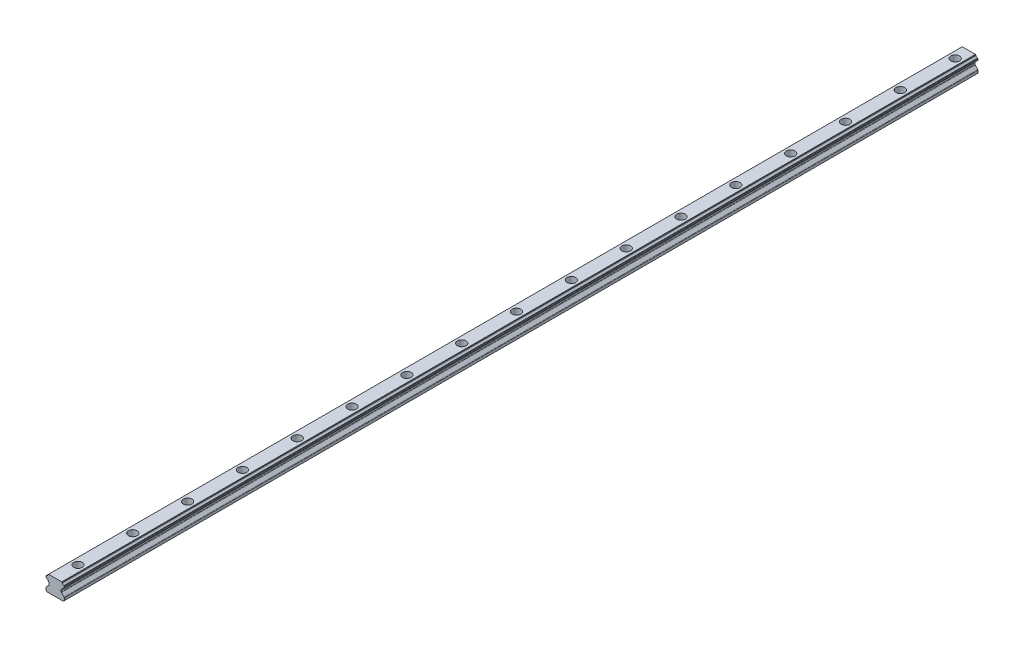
ISO-10303-21;
HEADER;
FILE_DESCRIPTION(('STEP AP214'),'2;1');
FILE_NAME('part.step','',(''),(''),'','','');
FILE_SCHEMA(('AUTOMOTIVE_DESIGN { 1 0 10303 214 1 1 1 1 }'));
ENDSEC;
DATA;
#1=APPLICATION_CONTEXT('core data for automotive mechanical design processes');
#2=APPLICATION_PROTOCOL_DEFINITION('international standard','automotive_design',2000,#1);
#3=PRODUCT_CONTEXT('',#1,'mechanical');
#4=PRODUCT('Part','Part','',(#3));
#5=PRODUCT_RELATED_PRODUCT_CATEGORY('part','',(#4));
#6=PRODUCT_DEFINITION_FORMATION('','',#4);
#7=PRODUCT_DEFINITION_CONTEXT('part definition',#1,'design');
#8=PRODUCT_DEFINITION('design','',#6,#7);
#9=PRODUCT_DEFINITION_SHAPE('','',#8);
#10=(LENGTH_UNIT() NAMED_UNIT(*) SI_UNIT(.MILLI.,.METRE.));
#11=(NAMED_UNIT(*) PLANE_ANGLE_UNIT() SI_UNIT($,.RADIAN.));
#12=(NAMED_UNIT(*) SI_UNIT($,.STERADIAN.) SOLID_ANGLE_UNIT());
#13=UNCERTAINTY_MEASURE_WITH_UNIT(LENGTH_MEASURE(1.E-05),#10,'distance_accuracy_value','');
#14=(GEOMETRIC_REPRESENTATION_CONTEXT(3) GLOBAL_UNCERTAINTY_ASSIGNED_CONTEXT((#13)) GLOBAL_UNIT_ASSIGNED_CONTEXT((#10,
#11,#12)) REPRESENTATION_CONTEXT('',''));
#15=CARTESIAN_POINT('',(0.,0.,0.));
#16=DIRECTION('',(0.,0.,1.));
#17=DIRECTION('',(1.,0.,0.));
#18=AXIS2_PLACEMENT_3D('',#15,#16,#17);
#19=CARTESIAN_POINT('',(9.32179000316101,4.75470765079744,1000.));
#20=DIRECTION('',(0.,0.,-1.));
#21=DIRECTION('',(-1.,0.,0.));
#22=AXIS2_PLACEMENT_3D('',#19,#20,#21);
#23=CYLINDRICAL_SURFACE('',#22,0.499999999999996);
#24=CARTESIAN_POINT('',(9.32179000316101,4.75470765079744,0.));
#25=DIRECTION('',(0.,0.,1.));
#26=DIRECTION('',(1.,0.,0.));
#27=AXIS2_PLACEMENT_3D('',#24,#25,#26);
#28=CIRCLE('',#27,0.499999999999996);
#29=CARTESIAN_POINT('',(9.41235216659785,4.26297754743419,0.));
#30=VERTEX_POINT('',#29);
#31=CARTESIAN_POINT('',(9.67534339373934,4.40115426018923,0.));
#32=VERTEX_POINT('',#31);
#33=EDGE_CURVE('E350',#30,#32,#28,.T.);
#34=ORIENTED_EDGE('',*,*,#33,.T.);
#35=DIRECTION('',(0.,0.,-1.));
#36=VECTOR('',#35,1.);
#37=CARTESIAN_POINT('',(9.67534339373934,4.40115426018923,1000.));
#38=LINE('',#37,#36);
#39=CARTESIAN_POINT('',(9.67534339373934,4.40115426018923,1000.));
#40=VERTEX_POINT('',#39);
#41=EDGE_CURVE('E12',#40,#32,#38,.T.);
#42=ORIENTED_EDGE('',*,*,#41,.F.);
#43=CARTESIAN_POINT('',(9.32179000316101,4.75470765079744,1000.));
#44=DIRECTION('',(0.,0.,1.));
#45=DIRECTION('',(1.,0.,0.));
#46=AXIS2_PLACEMENT_3D('',#43,#44,#45);
#47=CIRCLE('',#46,0.499999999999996);
#48=CARTESIAN_POINT('',(9.41235216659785,4.26297754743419,1000.));
#49=VERTEX_POINT('',#48);
#50=EDGE_CURVE('E475',#49,#40,#47,.T.);
#51=ORIENTED_EDGE('',*,*,#50,.F.);
#52=DIRECTION('',(0.,0.,-1.));
#53=VECTOR('',#52,1.);
#54=CARTESIAN_POINT('',(9.41235216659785,4.26297754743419,1000.));
#55=LINE('',#54,#53);
#56=EDGE_CURVE('E346',#49,#30,#55,.T.);
#57=ORIENTED_EDGE('',*,*,#56,.T.);
#58=EDGE_LOOP('',(#34,#42,#51,#57));
#59=FACE_BOUND('',#58,.T.);
#60=ADVANCED_FACE('F45',(#59),#23,.T.);
#61=CARTESIAN_POINT('',(9.67534339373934,4.40115426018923,1000.));
#62=DIRECTION('',(-0.707106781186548,0.707106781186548,0.));
#63=DIRECTION('',(-0.707106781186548,-0.707106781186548,0.));
#64=AXIS2_PLACEMENT_3D('',#61,#62,#63);
#65=PLANE('',#64);
#66=DIRECTION('',(0.707106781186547,0.707106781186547,0.));
#67=VECTOR('',#66,1.);
#68=CARTESIAN_POINT('',(9.67534339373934,4.40115426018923,0.));
#69=LINE('',#68,#67);
#70=CARTESIAN_POINT('',(9.85355339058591,4.57936425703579,0.));
#71=VERTEX_POINT('',#70);
#72=EDGE_CURVE('E354',#32,#71,#69,.T.);
#73=ORIENTED_EDGE('',*,*,#72,.T.);
#74=DIRECTION('',(0.,0.,-1.));
#75=VECTOR('',#74,1.);
#76=CARTESIAN_POINT('',(9.85355339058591,4.57936425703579,1000.));
#77=LINE('',#76,#75);
#78=CARTESIAN_POINT('',(9.85355339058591,4.57936425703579,1000.));
#79=VERTEX_POINT('',#78);
#80=EDGE_CURVE('E54',#79,#71,#77,.T.);
#81=ORIENTED_EDGE('',*,*,#80,.F.);
#82=DIRECTION('',(0.707106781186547,0.707106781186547,0.));
#83=VECTOR('',#82,1.);
#84=CARTESIAN_POINT('',(9.67534339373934,4.40115426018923,1000.));
#85=LINE('',#84,#83);
#86=EDGE_CURVE('E207',#40,#79,#85,.T.);
#87=ORIENTED_EDGE('',*,*,#86,.F.);
#88=ORIENTED_EDGE('',*,*,#41,.T.);
#89=EDGE_LOOP('',(#73,#81,#87,#88));
#90=FACE_BOUND('',#89,.T.);
#91=ADVANCED_FACE('F779',(#90),#65,.F.);
#92=CARTESIAN_POINT('',(9.50000000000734,4.93291764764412,1000.));
#93=DIRECTION('',(0.,0.,-1.));
#94=DIRECTION('',(-1.,0.,0.));
#95=AXIS2_PLACEMENT_3D('',#92,#93,#94);
#96=CYLINDRICAL_SURFACE('',#95,0.50000000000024);
#97=CARTESIAN_POINT('',(9.50000000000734,4.93291764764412,0.));
#98=DIRECTION('',(0.,0.,1.));
#99=DIRECTION('',(1.,0.,0.));
#100=AXIS2_PLACEMENT_3D('',#97,#98,#99);
#101=CIRCLE('',#100,0.50000000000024);
#102=CARTESIAN_POINT('',(10.0000000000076,4.93291764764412,0.));
#103=VERTEX_POINT('',#102);
#104=EDGE_CURVE('E358',#71,#103,#101,.T.);
#105=ORIENTED_EDGE('',*,*,#104,.T.);
#106=DIRECTION('',(0.,0.,-1.));
#107=VECTOR('',#106,1.);
#108=CARTESIAN_POINT('',(10.0000000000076,4.93291764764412,1000.));
#109=LINE('',#108,#107);
#110=CARTESIAN_POINT('',(10.0000000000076,4.93291764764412,1000.));
#111=VERTEX_POINT('',#110);
#112=EDGE_CURVE('E622',#111,#103,#109,.T.);
#113=ORIENTED_EDGE('',*,*,#112,.F.);
#114=CARTESIAN_POINT('',(9.50000000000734,4.93291764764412,1000.));
#115=DIRECTION('',(0.,0.,1.));
#116=DIRECTION('',(1.,0.,0.));
#117=AXIS2_PLACEMENT_3D('',#114,#115,#116);
#118=CIRCLE('',#117,0.50000000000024);
#119=EDGE_CURVE('E632',#79,#111,#118,.T.);
#120=ORIENTED_EDGE('',*,*,#119,.F.);
#121=ORIENTED_EDGE('',*,*,#80,.T.);
#122=EDGE_LOOP('',(#105,#113,#120,#121));
#123=FACE_BOUND('',#122,.T.);
#124=ADVANCED_FACE('F630',(#123),#96,.T.);
#125=CARTESIAN_POINT('',(10.0000000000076,4.93291764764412,1000.));
#126=DIRECTION('',(-1.,0.,0.));
#127=DIRECTION('',(0.,0.,1.));
#128=AXIS2_PLACEMENT_3D('',#125,#126,#127);
#129=PLANE('',#128);
#130=DIRECTION('',(0.,1.,0.));
#131=VECTOR('',#130,1.);
#132=CARTESIAN_POINT('',(10.0000000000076,4.93291764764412,0.));
#133=LINE('',#132,#131);
#134=CARTESIAN_POINT('',(10.0000000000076,5.99014530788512,0.));
#135=VERTEX_POINT('',#134);
#136=EDGE_CURVE('E361',#103,#135,#133,.T.);
#137=ORIENTED_EDGE('',*,*,#136,.T.);
#138=DIRECTION('',(0.,0.,-1.));
#139=VECTOR('',#138,1.);
#140=CARTESIAN_POINT('',(10.0000000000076,5.99014530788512,1000.));
#141=LINE('',#140,#139);
#142=CARTESIAN_POINT('',(10.0000000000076,5.99014530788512,1000.));
#143=VERTEX_POINT('',#142);
#144=EDGE_CURVE('E618',#143,#135,#141,.T.);
#145=ORIENTED_EDGE('',*,*,#144,.F.);
#146=DIRECTION('',(0.,1.,0.));
#147=VECTOR('',#146,1.);
#148=CARTESIAN_POINT('',(10.0000000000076,4.93291764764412,1000.));
#149=LINE('',#148,#147);
#150=EDGE_CURVE('E651',#111,#143,#149,.T.);
#151=ORIENTED_EDGE('',*,*,#150,.F.);
#152=ORIENTED_EDGE('',*,*,#112,.T.);
#153=EDGE_LOOP('',(#137,#145,#151,#152));
#154=FACE_BOUND('',#153,.T.);
#155=ADVANCED_FACE('F641',(#154),#129,.F.);
#156=CARTESIAN_POINT('',(9.5000000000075,5.99014530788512,1000.));
#157=DIRECTION('',(0.,0.,-1.));
#158=DIRECTION('',(-1.,0.,0.));
#159=AXIS2_PLACEMENT_3D('',#156,#157,#158);
#160=CYLINDRICAL_SURFACE('',#159,0.500000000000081);
#161=CARTESIAN_POINT('',(9.5000000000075,5.99014530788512,0.));
#162=DIRECTION('',(0.,0.,1.));
#163=DIRECTION('',(1.,0.,0.));
#164=AXIS2_PLACEMENT_3D('',#161,#162,#163);
#165=CIRCLE('',#164,0.500000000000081);
#166=CARTESIAN_POINT('',(9.8535533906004,6.34369869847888,0.));
#167=VERTEX_POINT('',#166);
#168=EDGE_CURVE('E364',#135,#167,#165,.T.);
#169=ORIENTED_EDGE('',*,*,#168,.T.);
#170=DIRECTION('',(0.,0.,-1.));
#171=VECTOR('',#170,1.);
#172=CARTESIAN_POINT('',(9.8535533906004,6.34369869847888,1000.));
#173=LINE('',#172,#171);
#174=CARTESIAN_POINT('',(9.8535533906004,6.34369869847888,1000.));
#175=VERTEX_POINT('',#174);
#176=EDGE_CURVE('E614',#175,#167,#173,.T.);
#177=ORIENTED_EDGE('',*,*,#176,.F.);
#178=CARTESIAN_POINT('',(9.5000000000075,5.99014530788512,1000.));
#179=DIRECTION('',(0.,0.,1.));
#180=DIRECTION('',(1.,0.,0.));
#181=AXIS2_PLACEMENT_3D('',#178,#179,#180);
#182=CIRCLE('',#181,0.500000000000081);
#183=EDGE_CURVE('E647',#143,#175,#182,.T.);
#184=ORIENTED_EDGE('',*,*,#183,.F.);
#185=ORIENTED_EDGE('',*,*,#144,.T.);
#186=EDGE_LOOP('',(#169,#177,#184,#185));
#187=FACE_BOUND('',#186,.T.);
#188=ADVANCED_FACE('F645',(#187),#160,.T.);
#189=CARTESIAN_POINT('',(9.8535533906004,6.34369869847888,1000.));
#190=DIRECTION('',(-0.707106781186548,-0.707106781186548,0.));
#191=DIRECTION('',(0.707106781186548,-0.707106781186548,0.));
#192=AXIS2_PLACEMENT_3D('',#189,#190,#191);
#193=PLANE('',#192);
#194=DIRECTION('',(-0.707106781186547,0.707106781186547,0.));
#195=VECTOR('',#194,1.);
#196=CARTESIAN_POINT('',(9.8535533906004,6.34369869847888,0.));
#197=LINE('',#196,#195);
#198=CARTESIAN_POINT('',(9.6633483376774,6.53390375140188,0.));
#199=VERTEX_POINT('',#198);
#200=EDGE_CURVE('E367',#167,#199,#197,.T.);
#201=ORIENTED_EDGE('',*,*,#200,.T.);
#202=DIRECTION('',(0.,0.,-1.));
#203=VECTOR('',#202,1.);
#204=CARTESIAN_POINT('',(9.6633483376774,6.53390375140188,1000.));
#205=LINE('',#204,#203);
#206=CARTESIAN_POINT('',(9.6633483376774,6.53390375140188,1000.));
#207=VERTEX_POINT('',#206);
#208=EDGE_CURVE('E610',#207,#199,#205,.T.);
#209=ORIENTED_EDGE('',*,*,#208,.F.);
#210=DIRECTION('',(-0.707106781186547,0.707106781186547,0.));
#211=VECTOR('',#210,1.);
#212=CARTESIAN_POINT('',(9.8535533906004,6.34369869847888,1000.));
#213=LINE('',#212,#211);
#214=EDGE_CURVE('E650',#175,#207,#213,.T.);
#215=ORIENTED_EDGE('',*,*,#214,.F.);
#216=ORIENTED_EDGE('',*,*,#176,.T.);
#217=EDGE_LOOP('',(#201,#209,#215,#216));
#218=FACE_BOUND('',#217,.T.);
#219=ADVANCED_FACE('F792',(#218),#193,.F.);
#220=CARTESIAN_POINT('',(9.30979494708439,6.180350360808,1000.));
#221=DIRECTION('',(0.,0.,-1.));
#222=DIRECTION('',(-1.,0.,0.));
#223=AXIS2_PLACEMENT_3D('',#220,#221,#222);
#224=CYLINDRICAL_SURFACE('',#223,0.500000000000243);
#225=CARTESIAN_POINT('',(9.30979494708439,6.180350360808,0.));
#226=DIRECTION('',(0.,0.,1.));
#227=DIRECTION('',(1.,0.,0.));
#228=AXIS2_PLACEMENT_3D('',#225,#226,#227);
#229=CIRCLE('',#228,0.500000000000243);
#230=CARTESIAN_POINT('',(9.40272767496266,6.67163796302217,0.));
#231=VERTEX_POINT('',#230);
#232=EDGE_CURVE('E370',#199,#231,#229,.T.);
#233=ORIENTED_EDGE('',*,*,#232,.T.);
#234=DIRECTION('',(0.,0.,-1.));
#235=VECTOR('',#234,1.);
#236=CARTESIAN_POINT('',(9.40272767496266,6.67163796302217,1000.));
#237=LINE('',#236,#235);
#238=CARTESIAN_POINT('',(9.40272767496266,6.67163796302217,1000.));
#239=VERTEX_POINT('',#238);
#240=EDGE_CURVE('E606',#239,#231,#237,.T.);
#241=ORIENTED_EDGE('',*,*,#240,.F.);
#242=CARTESIAN_POINT('',(9.30979494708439,6.180350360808,1000.));
#243=DIRECTION('',(0.,0.,1.));
#244=DIRECTION('',(1.,0.,0.));
#245=AXIS2_PLACEMENT_3D('',#242,#243,#244);
#246=CIRCLE('',#245,0.500000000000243);
#247=EDGE_CURVE('E655',#207,#239,#246,.T.);
#248=ORIENTED_EDGE('',*,*,#247,.F.);
#249=ORIENTED_EDGE('',*,*,#208,.T.);
#250=EDGE_LOOP('',(#233,#241,#248,#249));
#251=FACE_BOUND('',#250,.T.);
#252=ADVANCED_FACE('F795',(#251),#224,.T.);
#253=CARTESIAN_POINT('',(9.78003455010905,8.66626562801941,1000.));
#254=DIRECTION('',(0.,0.,-1.));
#255=DIRECTION('',(-1.,0.,0.));
#256=AXIS2_PLACEMENT_3D('',#253,#254,#255);
#257=CYLINDRICAL_SURFACE('',#256,2.03000000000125);
#258=CARTESIAN_POINT('',(9.78003455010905,8.66626562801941,0.));
#259=DIRECTION('',(0.,0.,-1.));
#260=DIRECTION('',(1.,0.,0.));
#261=AXIS2_PLACEMENT_3D('',#258,#259,#260);
#262=CIRCLE('',#261,2.03000000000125);
#263=CARTESIAN_POINT('',(7.78540688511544,8.28895875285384,0.));
#264=VERTEX_POINT('',#263);
#265=EDGE_CURVE('E373',#231,#264,#262,.T.);
#266=ORIENTED_EDGE('',*,*,#265,.T.);
#267=DIRECTION('',(0.,0.,-1.));
#268=VECTOR('',#267,1.);
#269=CARTESIAN_POINT('',(7.78540688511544,8.28895875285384,1000.));
#270=LINE('',#269,#268);
#271=CARTESIAN_POINT('',(7.78540688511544,8.28895875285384,1000.));
#272=VERTEX_POINT('',#271);
#273=EDGE_CURVE('E602',#272,#264,#270,.T.);
#274=ORIENTED_EDGE('',*,*,#273,.F.);
#275=CARTESIAN_POINT('',(9.78003455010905,8.66626562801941,1000.));
#276=DIRECTION('',(0.,0.,-1.));
#277=DIRECTION('',(1.,0.,0.));
#278=AXIS2_PLACEMENT_3D('',#275,#276,#277);
#279=CIRCLE('',#278,2.03000000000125);
#280=EDGE_CURVE('E662',#239,#272,#279,.T.);
#281=ORIENTED_EDGE('',*,*,#280,.F.);
#282=ORIENTED_EDGE('',*,*,#240,.T.);
#283=EDGE_LOOP('',(#266,#274,#281,#282));
#284=FACE_BOUND('',#283,.T.);
#285=ADVANCED_FACE('F799',(#284),#257,.F.);
#286=CARTESIAN_POINT('',(7.2941192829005,8.19602602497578,1000.));
#287=DIRECTION('',(0.,0.,-1.));
#288=DIRECTION('',(-1.,0.,0.));
#289=AXIS2_PLACEMENT_3D('',#286,#287,#288);
#290=CYLINDRICAL_SURFACE('',#289,0.500000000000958);
#291=CARTESIAN_POINT('',(7.2941192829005,8.19602602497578,0.));
#292=DIRECTION('',(0.,0.,1.));
#293=DIRECTION('',(1.,0.,0.));
#294=AXIS2_PLACEMENT_3D('',#291,#292,#293);
#295=CIRCLE('',#294,0.500000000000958);
#296=CARTESIAN_POINT('',(7.64767267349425,8.54957941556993,0.));
#297=VERTEX_POINT('',#296);
#298=EDGE_CURVE('E376',#264,#297,#295,.T.);
#299=ORIENTED_EDGE('',*,*,#298,.T.);
#300=DIRECTION('',(0.,0.,-1.));
#301=VECTOR('',#300,1.);
#302=CARTESIAN_POINT('',(7.64767267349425,8.54957941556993,1000.));
#303=LINE('',#302,#301);
#304=CARTESIAN_POINT('',(7.64767267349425,8.54957941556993,1000.));
#305=VERTEX_POINT('',#304);
#306=EDGE_CURVE('E598',#305,#297,#303,.T.);
#307=ORIENTED_EDGE('',*,*,#306,.F.);
#308=CARTESIAN_POINT('',(7.2941192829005,8.19602602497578,1000.));
#309=DIRECTION('',(0.,0.,1.));
#310=DIRECTION('',(1.,0.,0.));
#311=AXIS2_PLACEMENT_3D('',#308,#309,#310);
#312=CIRCLE('',#311,0.500000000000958);
#313=EDGE_CURVE('E665',#272,#305,#312,.T.);
#314=ORIENTED_EDGE('',*,*,#313,.F.);
#315=ORIENTED_EDGE('',*,*,#273,.T.);
#316=EDGE_LOOP('',(#299,#307,#314,#315));
#317=FACE_BOUND('',#316,.T.);
#318=ADVANCED_FACE('F803',(#317),#290,.T.);
#319=CARTESIAN_POINT('',(7.64767267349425,8.54957941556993,1000.));
#320=DIRECTION('',(-0.707106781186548,-0.707106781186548,0.));
#321=DIRECTION('',(0.707106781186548,-0.707106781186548,0.));
#322=AXIS2_PLACEMENT_3D('',#319,#320,#321);
#323=PLANE('',#322);
#324=DIRECTION('',(-0.707106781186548,0.707106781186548,0.));
#325=VECTOR('',#324,1.);
#326=CARTESIAN_POINT('',(7.64767267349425,8.54957941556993,0.));
#327=LINE('',#326,#325);
#328=CARTESIAN_POINT('',(7.23072061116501,8.96653147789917,0.));
#329=VERTEX_POINT('',#328);
#330=EDGE_CURVE('E379',#297,#329,#327,.T.);
#331=ORIENTED_EDGE('',*,*,#330,.T.);
#332=DIRECTION('',(0.,0.,-1.));
#333=VECTOR('',#332,1.);
#334=CARTESIAN_POINT('',(7.23072061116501,8.96653147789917,1000.));
#335=LINE('',#334,#333);
#336=CARTESIAN_POINT('',(7.23072061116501,8.96653147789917,1000.));
#337=VERTEX_POINT('',#336);
#338=EDGE_CURVE('E594',#337,#329,#335,.T.);
#339=ORIENTED_EDGE('',*,*,#338,.F.);
#340=DIRECTION('',(-0.707106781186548,0.707106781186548,0.));
#341=VECTOR('',#340,1.);
#342=CARTESIAN_POINT('',(7.64767267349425,8.54957941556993,1000.));
#343=LINE('',#342,#341);
#344=EDGE_CURVE('E668',#305,#337,#343,.T.);
#345=ORIENTED_EDGE('',*,*,#344,.F.);
#346=ORIENTED_EDGE('',*,*,#306,.T.);
#347=EDGE_LOOP('',(#331,#339,#345,#346));
#348=FACE_BOUND('',#347,.T.);
#349=ADVANCED_FACE('F807',(#348),#323,.F.);
#350=CARTESIAN_POINT('',(7.23072061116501,8.96653147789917,1000.));
#351=DIRECTION('',(0.,-1.,0.));
#352=DIRECTION('',(0.,0.,-1.));
#353=AXIS2_PLACEMENT_3D('',#350,#351,#352);
#354=PLANE('',#353);
#355=CARTESIAN_POINT('',(0.,8.96653147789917,74.9999999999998));
#356=DIRECTION('',(0.,1.,0.));
#357=DIRECTION('',(0.,0.,1.));
#358=AXIS2_PLACEMENT_3D('',#355,#356,#357);
#359=CIRCLE('',#358,4.75);
#360=CARTESIAN_POINT('',(0.,8.96653147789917,79.7499999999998));
#361=VERTEX_POINT('',#360);
#362=EDGE_CURVE('E1890',#361,#361,#359,.T.);
#363=ORIENTED_EDGE('',*,*,#362,.F.);
#364=EDGE_LOOP('',(#363));
#365=FACE_BOUND('',#364,.T.);
#366=CARTESIAN_POINT('',(0.,8.96653147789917,135.));
#367=DIRECTION('',(0.,1.,0.));
#368=DIRECTION('',(0.,0.,1.));
#369=AXIS2_PLACEMENT_3D('',#366,#367,#368);
#370=CIRCLE('',#369,4.75);
#371=CARTESIAN_POINT('',(0.,8.96653147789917,139.75));
#372=VERTEX_POINT('',#371);
#373=EDGE_CURVE('E1904',#372,#372,#370,.T.);
#374=ORIENTED_EDGE('',*,*,#373,.F.);
#375=EDGE_LOOP('',(#374));
#376=FACE_BOUND('',#375,.T.);
#377=CARTESIAN_POINT('',(0.,8.96653147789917,194.999999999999));
#378=DIRECTION('',(0.,1.,0.));
#379=DIRECTION('',(0.,0.,1.));
#380=AXIS2_PLACEMENT_3D('',#377,#378,#379);
#381=CIRCLE('',#380,4.75);
#382=CARTESIAN_POINT('',(0.,8.96653147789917,199.749999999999));
#383=VERTEX_POINT('',#382);
#384=EDGE_CURVE('E1920',#383,#383,#381,.T.);
#385=ORIENTED_EDGE('',*,*,#384,.F.);
#386=EDGE_LOOP('',(#385));
#387=FACE_BOUND('',#386,.T.);
#388=CARTESIAN_POINT('',(0.,8.96653147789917,254.999999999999));
#389=DIRECTION('',(0.,1.,0.));
#390=DIRECTION('',(0.,0.,1.));
#391=AXIS2_PLACEMENT_3D('',#388,#389,#390);
#392=CIRCLE('',#391,4.75);
#393=CARTESIAN_POINT('',(0.,8.96653147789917,259.749999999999));
#394=VERTEX_POINT('',#393);
#395=EDGE_CURVE('E1936',#394,#394,#392,.T.);
#396=ORIENTED_EDGE('',*,*,#395,.F.);
#397=EDGE_LOOP('',(#396));
#398=FACE_BOUND('',#397,.T.);
#399=CARTESIAN_POINT('',(0.,8.96653147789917,314.999999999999));
#400=DIRECTION('',(0.,1.,0.));
#401=DIRECTION('',(0.,0.,1.));
#402=AXIS2_PLACEMENT_3D('',#399,#400,#401);
#403=CIRCLE('',#402,4.75);
#404=CARTESIAN_POINT('',(0.,8.96653147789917,319.749999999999));
#405=VERTEX_POINT('',#404);
#406=EDGE_CURVE('E1952',#405,#405,#403,.T.);
#407=ORIENTED_EDGE('',*,*,#406,.F.);
#408=EDGE_LOOP('',(#407));
#409=FACE_BOUND('',#408,.T.);
#410=CARTESIAN_POINT('',(0.,8.96653147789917,374.999999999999));
#411=DIRECTION('',(0.,1.,0.));
#412=DIRECTION('',(0.,0.,1.));
#413=AXIS2_PLACEMENT_3D('',#410,#411,#412);
#414=CIRCLE('',#413,4.75);
#415=CARTESIAN_POINT('',(0.,8.96653147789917,379.749999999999));
#416=VERTEX_POINT('',#415);
#417=EDGE_CURVE('E1968',#416,#416,#414,.T.);
#418=ORIENTED_EDGE('',*,*,#417,.F.);
#419=EDGE_LOOP('',(#418));
#420=FACE_BOUND('',#419,.T.);
#421=CARTESIAN_POINT('',(0.,8.96653147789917,434.999999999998));
#422=DIRECTION('',(0.,1.,0.));
#423=DIRECTION('',(0.,0.,1.));
#424=AXIS2_PLACEMENT_3D('',#421,#422,#423);
#425=CIRCLE('',#424,4.75);
#426=CARTESIAN_POINT('',(0.,8.96653147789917,439.749999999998));
#427=VERTEX_POINT('',#426);
#428=EDGE_CURVE('E1984',#427,#427,#425,.T.);
#429=ORIENTED_EDGE('',*,*,#428,.F.);
#430=EDGE_LOOP('',(#429));
#431=FACE_BOUND('',#430,.T.);
#432=CARTESIAN_POINT('',(0.,8.96653147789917,494.999999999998));
#433=DIRECTION('',(0.,1.,0.));
#434=DIRECTION('',(0.,0.,1.));
#435=AXIS2_PLACEMENT_3D('',#432,#433,#434);
#436=CIRCLE('',#435,4.75);
#437=CARTESIAN_POINT('',(0.,8.96653147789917,499.749999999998));
#438=VERTEX_POINT('',#437);
#439=EDGE_CURVE('E2000',#438,#438,#436,.T.);
#440=ORIENTED_EDGE('',*,*,#439,.F.);
#441=EDGE_LOOP('',(#440));
#442=FACE_BOUND('',#441,.T.);
#443=CARTESIAN_POINT('',(0.,8.96653147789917,554.999999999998));
#444=DIRECTION('',(0.,1.,0.));
#445=DIRECTION('',(0.,0.,1.));
#446=AXIS2_PLACEMENT_3D('',#443,#444,#445);
#447=CIRCLE('',#446,4.75);
#448=CARTESIAN_POINT('',(0.,8.96653147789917,559.749999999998));
#449=VERTEX_POINT('',#448);
#450=EDGE_CURVE('E2016',#449,#449,#447,.T.);
#451=ORIENTED_EDGE('',*,*,#450,.F.);
#452=EDGE_LOOP('',(#451));
#453=FACE_BOUND('',#452,.T.);
#454=CARTESIAN_POINT('',(0.,8.96653147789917,614.999999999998));
#455=DIRECTION('',(0.,1.,0.));
#456=DIRECTION('',(0.,0.,1.));
#457=AXIS2_PLACEMENT_3D('',#454,#455,#456);
#458=CIRCLE('',#457,4.75);
#459=CARTESIAN_POINT('',(0.,8.96653147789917,619.749999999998));
#460=VERTEX_POINT('',#459);
#461=EDGE_CURVE('E2032',#460,#460,#458,.T.);
#462=ORIENTED_EDGE('',*,*,#461,.F.);
#463=EDGE_LOOP('',(#462));
#464=FACE_BOUND('',#463,.T.);
#465=CARTESIAN_POINT('',(0.,8.96653147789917,674.999999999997));
#466=DIRECTION('',(0.,1.,0.));
#467=DIRECTION('',(0.,0.,1.));
#468=AXIS2_PLACEMENT_3D('',#465,#466,#467);
#469=CIRCLE('',#468,4.75);
#470=CARTESIAN_POINT('',(0.,8.96653147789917,679.749999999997));
#471=VERTEX_POINT('',#470);
#472=EDGE_CURVE('E2048',#471,#471,#469,.T.);
#473=ORIENTED_EDGE('',*,*,#472,.F.);
#474=EDGE_LOOP('',(#473));
#475=FACE_BOUND('',#474,.T.);
#476=CARTESIAN_POINT('',(0.,8.96653147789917,734.999999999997));
#477=DIRECTION('',(0.,1.,0.));
#478=DIRECTION('',(0.,0.,1.));
#479=AXIS2_PLACEMENT_3D('',#476,#477,#478);
#480=CIRCLE('',#479,4.75);
#481=CARTESIAN_POINT('',(0.,8.96653147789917,739.749999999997));
#482=VERTEX_POINT('',#481);
#483=EDGE_CURVE('E2064',#482,#482,#480,.T.);
#484=ORIENTED_EDGE('',*,*,#483,.F.);
#485=EDGE_LOOP('',(#484));
#486=FACE_BOUND('',#485,.T.);
#487=CARTESIAN_POINT('',(0.,8.96653147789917,794.999999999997));
#488=DIRECTION('',(0.,1.,0.));
#489=DIRECTION('',(0.,0.,1.));
#490=AXIS2_PLACEMENT_3D('',#487,#488,#489);
#491=CIRCLE('',#490,4.75);
#492=CARTESIAN_POINT('',(0.,8.96653147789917,799.749999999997));
#493=VERTEX_POINT('',#492);
#494=EDGE_CURVE('E2080',#493,#493,#491,.T.);
#495=ORIENTED_EDGE('',*,*,#494,.F.);
#496=EDGE_LOOP('',(#495));
#497=FACE_BOUND('',#496,.T.);
#498=CARTESIAN_POINT('',(0.,8.96653147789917,854.999999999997));
#499=DIRECTION('',(0.,1.,0.));
#500=DIRECTION('',(0.,0.,1.));
#501=AXIS2_PLACEMENT_3D('',#498,#499,#500);
#502=CIRCLE('',#501,4.75);
#503=CARTESIAN_POINT('',(0.,8.96653147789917,859.749999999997));
#504=VERTEX_POINT('',#503);
#505=EDGE_CURVE('E2096',#504,#504,#502,.T.);
#506=ORIENTED_EDGE('',*,*,#505,.F.);
#507=EDGE_LOOP('',(#506));
#508=FACE_BOUND('',#507,.T.);
#509=CARTESIAN_POINT('',(0.,8.96653147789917,914.999999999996));
#510=DIRECTION('',(0.,1.,0.));
#511=DIRECTION('',(0.,0.,1.));
#512=AXIS2_PLACEMENT_3D('',#509,#510,#511);
#513=CIRCLE('',#512,4.75);
#514=CARTESIAN_POINT('',(0.,8.96653147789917,919.749999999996));
#515=VERTEX_POINT('',#514);
#516=EDGE_CURVE('E2112',#515,#515,#513,.T.);
#517=ORIENTED_EDGE('',*,*,#516,.F.);
#518=EDGE_LOOP('',(#517));
#519=FACE_BOUND('',#518,.T.);
#520=CARTESIAN_POINT('',(0.,8.96653147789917,974.999999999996));
#521=DIRECTION('',(0.,1.,0.));
#522=DIRECTION('',(0.,0.,1.));
#523=AXIS2_PLACEMENT_3D('',#520,#521,#522);
#524=CIRCLE('',#523,4.75);
#525=CARTESIAN_POINT('',(0.,8.96653147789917,979.749999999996));
#526=VERTEX_POINT('',#525);
#527=EDGE_CURVE('E2128',#526,#526,#524,.T.);
#528=ORIENTED_EDGE('',*,*,#527,.F.);
#529=EDGE_LOOP('',(#528));
#530=FACE_BOUND('',#529,.T.);
#531=CARTESIAN_POINT('',(0.,8.96653147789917,15.));
#532=DIRECTION('',(0.,1.,0.));
#533=DIRECTION('',(0.,0.,1.));
#534=AXIS2_PLACEMENT_3D('',#531,#532,#533);
#535=CIRCLE('',#534,4.75);
#536=CARTESIAN_POINT('',(0.,8.96653147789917,19.75));
#537=VERTEX_POINT('',#536);
#538=EDGE_CURVE('E2144',#537,#537,#535,.T.);
#539=ORIENTED_EDGE('',*,*,#538,.F.);
#540=EDGE_LOOP('',(#539));
#541=FACE_BOUND('',#540,.T.);
#542=DIRECTION('',(-1.,0.,0.));
#543=VECTOR('',#542,1.);
#544=CARTESIAN_POINT('',(7.23072061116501,8.96653147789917,0.));
#545=LINE('',#544,#543);
#546=CARTESIAN_POINT('',(-7.23072061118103,8.96653147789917,0.));
#547=VERTEX_POINT('',#546);
#548=EDGE_CURVE('E382',#329,#547,#545,.T.);
#549=ORIENTED_EDGE('',*,*,#548,.T.);
#550=DIRECTION('',(0.,0.,-1.));
#551=VECTOR('',#550,1.);
#552=CARTESIAN_POINT('',(-7.23072061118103,8.96653147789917,1000.));
#553=LINE('',#552,#551);
#554=CARTESIAN_POINT('',(-7.23072061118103,8.96653147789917,1000.));
#555=VERTEX_POINT('',#554);
#556=EDGE_CURVE('E590',#555,#547,#553,.T.);
#557=ORIENTED_EDGE('',*,*,#556,.F.);
#558=DIRECTION('',(-1.,0.,0.));
#559=VECTOR('',#558,1.);
#560=CARTESIAN_POINT('',(7.23072061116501,8.96653147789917,1000.));
#561=LINE('',#560,#559);
#562=EDGE_CURVE('E671',#337,#555,#561,.T.);
#563=ORIENTED_EDGE('',*,*,#562,.F.);
#564=ORIENTED_EDGE('',*,*,#338,.T.);
#565=EDGE_LOOP('',(#549,#557,#563,#564));
#566=FACE_BOUND('',#565,.T.);
#567=ADVANCED_FACE('F811',(#365,#376,#387,#398,#409,#420,#431,#442,#453,#464,#475,#486,#497,
#508,#519,#530,#541,#566),#354,.F.);
#568=CARTESIAN_POINT('',(-7.23072061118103,8.96653147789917,1000.));
#569=DIRECTION('',(0.707106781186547,-0.707106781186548,0.));
#570=DIRECTION('',(0.707106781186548,0.707106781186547,0.));
#571=AXIS2_PLACEMENT_3D('',#568,#569,#570);
#572=PLANE('',#571);
#573=DIRECTION('',(-0.707106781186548,-0.707106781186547,0.));
#574=VECTOR('',#573,1.);
#575=CARTESIAN_POINT('',(-7.23072061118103,8.96653147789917,0.));
#576=LINE('',#575,#574);
#577=CARTESIAN_POINT('',(-7.64767267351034,8.54957941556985,0.));
#578=VERTEX_POINT('',#577);
#579=EDGE_CURVE('E385',#547,#578,#576,.T.);
#580=ORIENTED_EDGE('',*,*,#579,.T.);
#581=DIRECTION('',(0.,0.,-1.));
#582=VECTOR('',#581,1.);
#583=CARTESIAN_POINT('',(-7.64767267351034,8.54957941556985,1000.));
#584=LINE('',#583,#582);
#585=CARTESIAN_POINT('',(-7.64767267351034,8.54957941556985,1000.));
#586=VERTEX_POINT('',#585);
#587=EDGE_CURVE('E586',#586,#578,#584,.T.);
#588=ORIENTED_EDGE('',*,*,#587,.F.);
#589=DIRECTION('',(-0.707106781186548,-0.707106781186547,0.));
#590=VECTOR('',#589,1.);
#591=CARTESIAN_POINT('',(-7.23072061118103,8.96653147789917,1000.));
#592=LINE('',#591,#590);
#593=EDGE_CURVE('E674',#555,#586,#592,.T.);
#594=ORIENTED_EDGE('',*,*,#593,.F.);
#595=ORIENTED_EDGE('',*,*,#556,.T.);
#596=EDGE_LOOP('',(#580,#588,#594,#595));
#597=FACE_BOUND('',#596,.T.);
#598=ADVANCED_FACE('F815',(#597),#572,.F.);
#599=CARTESIAN_POINT('',(-7.29411928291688,8.1960260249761,1000.));
#600=DIRECTION('',(0.,0.,-1.));
#601=DIRECTION('',(-1.,0.,0.));
#602=AXIS2_PLACEMENT_3D('',#599,#600,#601);
#603=CYLINDRICAL_SURFACE('',#602,0.50000000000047);
#604=CARTESIAN_POINT('',(-7.29411928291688,8.1960260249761,0.));
#605=DIRECTION('',(0.,0.,1.));
#606=DIRECTION('',(1.,0.,0.));
#607=AXIS2_PLACEMENT_3D('',#604,#605,#606);
#608=CIRCLE('',#607,0.50000000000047);
#609=CARTESIAN_POINT('',(-7.78540688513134,8.28895875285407,0.));
#610=VERTEX_POINT('',#609);
#611=EDGE_CURVE('E388',#578,#610,#608,.T.);
#612=ORIENTED_EDGE('',*,*,#611,.T.);
#613=DIRECTION('',(0.,0.,-1.));
#614=VECTOR('',#613,1.);
#615=CARTESIAN_POINT('',(-7.78540688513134,8.28895875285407,1000.));
#616=LINE('',#615,#614);
#617=CARTESIAN_POINT('',(-7.78540688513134,8.28895875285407,1000.));
#618=VERTEX_POINT('',#617);
#619=EDGE_CURVE('E582',#618,#610,#616,.T.);
#620=ORIENTED_EDGE('',*,*,#619,.F.);
#621=CARTESIAN_POINT('',(-7.29411928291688,8.1960260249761,1000.));
#622=DIRECTION('',(0.,0.,1.));
#623=DIRECTION('',(1.,0.,0.));
#624=AXIS2_PLACEMENT_3D('',#621,#622,#623);
#625=CIRCLE('',#624,0.50000000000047);
#626=EDGE_CURVE('E677',#586,#618,#625,.T.);
#627=ORIENTED_EDGE('',*,*,#626,.F.);
#628=ORIENTED_EDGE('',*,*,#587,.T.);
#629=EDGE_LOOP('',(#612,#620,#627,#628));
#630=FACE_BOUND('',#629,.T.);
#631=ADVANCED_FACE('F819',(#630),#603,.T.);
#632=CARTESIAN_POINT('',(-9.78003455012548,8.66626562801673,1000.));
#633=DIRECTION('',(0.,0.,-1.));
#634=DIRECTION('',(-1.,0.,0.));
#635=AXIS2_PLACEMENT_3D('',#632,#633,#634);
#636=CYLINDRICAL_SURFACE('',#635,2.03000000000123);
#637=CARTESIAN_POINT('',(-9.78003455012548,8.66626562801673,0.));
#638=DIRECTION('',(0.,0.,-1.));
#639=DIRECTION('',(1.,0.,0.));
#640=AXIS2_PLACEMENT_3D('',#637,#638,#639);
#641=CIRCLE('',#640,2.03000000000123);
#642=CARTESIAN_POINT('',(-9.40272767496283,6.67163796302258,0.));
#643=VERTEX_POINT('',#642);
#644=EDGE_CURVE('E391',#610,#643,#641,.T.);
#645=ORIENTED_EDGE('',*,*,#644,.T.);
#646=DIRECTION('',(0.,0.,-1.));
#647=VECTOR('',#646,1.);
#648=CARTESIAN_POINT('',(-9.40272767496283,6.67163796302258,1000.));
#649=LINE('',#648,#647);
#650=CARTESIAN_POINT('',(-9.40272767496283,6.67163796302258,1000.));
#651=VERTEX_POINT('',#650);
#652=EDGE_CURVE('E578',#651,#643,#649,.T.);
#653=ORIENTED_EDGE('',*,*,#652,.F.);
#654=CARTESIAN_POINT('',(-9.78003455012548,8.66626562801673,1000.));
#655=DIRECTION('',(0.,0.,-1.));
#656=DIRECTION('',(1.,0.,0.));
#657=AXIS2_PLACEMENT_3D('',#654,#655,#656);
#658=CIRCLE('',#657,2.03000000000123);
#659=EDGE_CURVE('E680',#618,#651,#658,.T.);
#660=ORIENTED_EDGE('',*,*,#659,.F.);
#661=ORIENTED_EDGE('',*,*,#619,.T.);
#662=EDGE_LOOP('',(#645,#653,#660,#661));
#663=FACE_BOUND('',#662,.T.);
#664=ADVANCED_FACE('F823',(#663),#636,.F.);
#665=CARTESIAN_POINT('',(-9.30979494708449,6.18035036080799,1000.));
#666=DIRECTION('',(0.,0.,-1.));
#667=DIRECTION('',(-1.,0.,0.));
#668=AXIS2_PLACEMENT_3D('',#665,#666,#667);
#669=CYLINDRICAL_SURFACE('',#668,0.500000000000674);
#670=CARTESIAN_POINT('',(-9.30979494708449,6.18035036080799,0.));
#671=DIRECTION('',(0.,0.,1.));
#672=DIRECTION('',(1.,0.,0.));
#673=AXIS2_PLACEMENT_3D('',#670,#671,#672);
#674=CIRCLE('',#673,0.500000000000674);
#675=CARTESIAN_POINT('',(-9.66334833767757,6.53390375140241,0.));
#676=VERTEX_POINT('',#675);
#677=EDGE_CURVE('E394',#643,#676,#674,.T.);
#678=ORIENTED_EDGE('',*,*,#677,.T.);
#679=DIRECTION('',(0.,0.,-1.));
#680=VECTOR('',#679,1.);
#681=CARTESIAN_POINT('',(-9.66334833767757,6.53390375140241,1000.));
#682=LINE('',#681,#680);
#683=CARTESIAN_POINT('',(-9.66334833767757,6.53390375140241,1000.));
#684=VERTEX_POINT('',#683);
#685=EDGE_CURVE('E574',#684,#676,#682,.T.);
#686=ORIENTED_EDGE('',*,*,#685,.F.);
#687=CARTESIAN_POINT('',(-9.30979494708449,6.18035036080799,1000.));
#688=DIRECTION('',(0.,0.,1.));
#689=DIRECTION('',(1.,0.,0.));
#690=AXIS2_PLACEMENT_3D('',#687,#688,#689);
#691=CIRCLE('',#690,0.500000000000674);
#692=EDGE_CURVE('E683',#651,#684,#691,.T.);
#693=ORIENTED_EDGE('',*,*,#692,.F.);
#694=ORIENTED_EDGE('',*,*,#652,.T.);
#695=EDGE_LOOP('',(#678,#686,#693,#694));
#696=FACE_BOUND('',#695,.T.);
#697=ADVANCED_FACE('F827',(#696),#669,.T.);
#698=CARTESIAN_POINT('',(-9.66334833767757,6.53390375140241,1000.));
#699=DIRECTION('',(0.707106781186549,-0.707106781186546,0.));
#700=DIRECTION('',(0.707106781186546,0.707106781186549,0.));
#701=AXIS2_PLACEMENT_3D('',#698,#699,#700);
#702=PLANE('',#701);
#703=DIRECTION('',(-0.707106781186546,-0.707106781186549,0.));
#704=VECTOR('',#703,1.);
#705=CARTESIAN_POINT('',(-9.66334833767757,6.53390375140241,0.));
#706=LINE('',#705,#704);
#707=CARTESIAN_POINT('',(-9.85355339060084,6.34369869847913,0.));
#708=VERTEX_POINT('',#707);
#709=EDGE_CURVE('E397',#676,#708,#706,.T.);
#710=ORIENTED_EDGE('',*,*,#709,.T.);
#711=DIRECTION('',(0.,0.,-1.));
#712=VECTOR('',#711,1.);
#713=CARTESIAN_POINT('',(-9.85355339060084,6.34369869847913,1000.));
#714=LINE('',#713,#712);
#715=CARTESIAN_POINT('',(-9.85355339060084,6.34369869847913,1000.));
#716=VERTEX_POINT('',#715);
#717=EDGE_CURVE('E570',#716,#708,#714,.T.);
#718=ORIENTED_EDGE('',*,*,#717,.F.);
#719=DIRECTION('',(-0.707106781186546,-0.707106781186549,0.));
#720=VECTOR('',#719,1.);
#721=CARTESIAN_POINT('',(-9.66334833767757,6.53390375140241,1000.));
#722=LINE('',#721,#720);
#723=EDGE_CURVE('E686',#684,#716,#722,.T.);
#724=ORIENTED_EDGE('',*,*,#723,.F.);
#725=ORIENTED_EDGE('',*,*,#685,.T.);
#726=EDGE_LOOP('',(#710,#718,#724,#725));
#727=FACE_BOUND('',#726,.T.);
#728=ADVANCED_FACE('F831',(#727),#702,.F.);
#729=CARTESIAN_POINT('',(-9.500000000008,5.9901453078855,1000.));
#730=DIRECTION('',(0.,0.,-1.));
#731=DIRECTION('',(-1.,0.,0.));
#732=AXIS2_PLACEMENT_3D('',#729,#730,#731);
#733=CYLINDRICAL_SURFACE('',#732,0.499999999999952);
#734=CARTESIAN_POINT('',(-9.500000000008,5.9901453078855,0.));
#735=DIRECTION('',(0.,0.,1.));
#736=DIRECTION('',(1.,0.,0.));
#737=AXIS2_PLACEMENT_3D('',#734,#735,#736);
#738=CIRCLE('',#737,0.499999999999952);
#739=CARTESIAN_POINT('',(-10.000000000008,5.9901453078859,0.));
#740=VERTEX_POINT('',#739);
#741=EDGE_CURVE('E400',#708,#740,#738,.T.);
#742=ORIENTED_EDGE('',*,*,#741,.T.);
#743=DIRECTION('',(0.,0.,-1.));
#744=VECTOR('',#743,1.);
#745=CARTESIAN_POINT('',(-10.000000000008,5.9901453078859,1000.));
#746=LINE('',#745,#744);
#747=CARTESIAN_POINT('',(-10.000000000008,5.9901453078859,1000.));
#748=VERTEX_POINT('',#747);
#749=EDGE_CURVE('E566',#748,#740,#746,.T.);
#750=ORIENTED_EDGE('',*,*,#749,.F.);
#751=CARTESIAN_POINT('',(-9.500000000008,5.9901453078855,1000.));
#752=DIRECTION('',(0.,0.,1.));
#753=DIRECTION('',(1.,0.,0.));
#754=AXIS2_PLACEMENT_3D('',#751,#752,#753);
#755=CIRCLE('',#754,0.499999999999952);
#756=EDGE_CURVE('E689',#716,#748,#755,.T.);
#757=ORIENTED_EDGE('',*,*,#756,.F.);
#758=ORIENTED_EDGE('',*,*,#717,.T.);
#759=EDGE_LOOP('',(#742,#750,#757,#758));
#760=FACE_BOUND('',#759,.T.);
#761=ADVANCED_FACE('F835',(#760),#733,.T.);
#762=CARTESIAN_POINT('',(-10.000000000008,5.9901453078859,1000.));
#763=DIRECTION('',(1.,0.,0.));
#764=DIRECTION('',(0.,0.,-1.));
#765=AXIS2_PLACEMENT_3D('',#762,#763,#764);
#766=PLANE('',#765);
#767=DIRECTION('',(0.,-1.,0.));
#768=VECTOR('',#767,1.);
#769=CARTESIAN_POINT('',(-10.000000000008,5.9901453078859,0.));
#770=LINE('',#769,#768);
#771=CARTESIAN_POINT('',(-10.000000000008,4.9329176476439,0.));
#772=VERTEX_POINT('',#771);
#773=EDGE_CURVE('E403',#740,#772,#770,.T.);
#774=ORIENTED_EDGE('',*,*,#773,.T.);
#775=DIRECTION('',(0.,0.,-1.));
#776=VECTOR('',#775,1.);
#777=CARTESIAN_POINT('',(-10.000000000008,4.9329176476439,1000.));
#778=LINE('',#777,#776);
#779=CARTESIAN_POINT('',(-10.000000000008,4.9329176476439,1000.));
#780=VERTEX_POINT('',#779);
#781=EDGE_CURVE('E562',#780,#772,#778,.T.);
#782=ORIENTED_EDGE('',*,*,#781,.F.);
#783=DIRECTION('',(0.,-1.,0.));
#784=VECTOR('',#783,1.);
#785=CARTESIAN_POINT('',(-10.000000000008,5.9901453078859,1000.));
#786=LINE('',#785,#784);
#787=EDGE_CURVE('E692',#748,#780,#786,.T.);
#788=ORIENTED_EDGE('',*,*,#787,.F.);
#789=ORIENTED_EDGE('',*,*,#749,.T.);
#790=EDGE_LOOP('',(#774,#782,#788,#789));
#791=FACE_BOUND('',#790,.T.);
#792=ADVANCED_FACE('F839',(#791),#766,.F.);
#793=CARTESIAN_POINT('',(-9.50000000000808,4.9329176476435,1000.));
#794=DIRECTION('',(0.,0.,-1.));
#795=DIRECTION('',(-1.,0.,0.));
#796=AXIS2_PLACEMENT_3D('',#793,#794,#795);
#797=CYLINDRICAL_SURFACE('',#796,0.499999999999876);
#798=CARTESIAN_POINT('',(-9.50000000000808,4.9329176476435,0.));
#799=DIRECTION('',(0.,0.,1.));
#800=DIRECTION('',(1.,0.,0.));
#801=AXIS2_PLACEMENT_3D('',#798,#799,#800);
#802=CIRCLE('',#801,0.499999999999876);
#803=CARTESIAN_POINT('',(-9.85355339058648,4.57936425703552,0.));
#804=VERTEX_POINT('',#803);
#805=EDGE_CURVE('E406',#772,#804,#802,.T.);
#806=ORIENTED_EDGE('',*,*,#805,.T.);
#807=DIRECTION('',(0.,0.,-1.));
#808=VECTOR('',#807,1.);
#809=CARTESIAN_POINT('',(-9.85355339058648,4.57936425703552,1000.));
#810=LINE('',#809,#808);
#811=CARTESIAN_POINT('',(-9.85355339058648,4.57936425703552,1000.));
#812=VERTEX_POINT('',#811);
#813=EDGE_CURVE('E558',#812,#804,#810,.T.);
#814=ORIENTED_EDGE('',*,*,#813,.F.);
#815=CARTESIAN_POINT('',(-9.50000000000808,4.9329176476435,1000.));
#816=DIRECTION('',(0.,0.,1.));
#817=DIRECTION('',(1.,0.,0.));
#818=AXIS2_PLACEMENT_3D('',#815,#816,#817);
#819=CIRCLE('',#818,0.499999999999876);
#820=EDGE_CURVE('E695',#780,#812,#819,.T.);
#821=ORIENTED_EDGE('',*,*,#820,.F.);
#822=ORIENTED_EDGE('',*,*,#781,.T.);
#823=EDGE_LOOP('',(#806,#814,#821,#822));
#824=FACE_BOUND('',#823,.T.);
#825=ADVANCED_FACE('F843',(#824),#797,.T.);
#826=CARTESIAN_POINT('',(-9.85355339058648,4.57936425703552,1000.));
#827=DIRECTION('',(0.707106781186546,0.707106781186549,0.));
#828=DIRECTION('',(-0.707106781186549,0.707106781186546,0.));
#829=AXIS2_PLACEMENT_3D('',#826,#827,#828);
#830=PLANE('',#829);
#831=DIRECTION('',(0.707106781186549,-0.707106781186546,0.));
#832=VECTOR('',#831,1.);
#833=CARTESIAN_POINT('',(-9.85355339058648,4.57936425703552,0.));
#834=LINE('',#833,#832);
#835=CARTESIAN_POINT('',(-9.67534339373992,4.40115426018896,0.));
#836=VERTEX_POINT('',#835);
#837=EDGE_CURVE('E409',#804,#836,#834,.T.);
#838=ORIENTED_EDGE('',*,*,#837,.T.);
#839=DIRECTION('',(0.,0.,-1.));
#840=VECTOR('',#839,1.);
#841=CARTESIAN_POINT('',(-9.67534339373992,4.40115426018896,1000.));
#842=LINE('',#841,#840);
#843=CARTESIAN_POINT('',(-9.67534339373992,4.40115426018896,1000.));
#844=VERTEX_POINT('',#843);
#845=EDGE_CURVE('E554',#844,#836,#842,.T.);
#846=ORIENTED_EDGE('',*,*,#845,.F.);
#847=DIRECTION('',(0.707106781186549,-0.707106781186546,0.));
#848=VECTOR('',#847,1.);
#849=CARTESIAN_POINT('',(-9.85355339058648,4.57936425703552,1000.));
#850=LINE('',#849,#848);
#851=EDGE_CURVE('E698',#812,#844,#850,.T.);
#852=ORIENTED_EDGE('',*,*,#851,.F.);
#853=ORIENTED_EDGE('',*,*,#813,.T.);
#854=EDGE_LOOP('',(#838,#846,#852,#853));
#855=FACE_BOUND('',#854,.T.);
#856=ADVANCED_FACE('F847',(#855),#830,.F.);
#857=CARTESIAN_POINT('',(-9.32179000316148,4.7547076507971,1000.));
#858=DIRECTION('',(0.,0.,-1.));
#859=DIRECTION('',(-1.,0.,0.));
#860=AXIS2_PLACEMENT_3D('',#857,#858,#859);
#861=CYLINDRICAL_SURFACE('',#860,0.500000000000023);
#862=CARTESIAN_POINT('',(-9.32179000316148,4.7547076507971,0.));
#863=DIRECTION('',(0.,0.,1.));
#864=DIRECTION('',(1.,0.,0.));
#865=AXIS2_PLACEMENT_3D('',#862,#863,#864);
#866=CIRCLE('',#865,0.500000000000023);
#867=CARTESIAN_POINT('',(-9.41235216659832,4.26297754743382,0.));
#868=VERTEX_POINT('',#867);
#869=EDGE_CURVE('E412',#836,#868,#866,.T.);
#870=ORIENTED_EDGE('',*,*,#869,.T.);
#871=DIRECTION('',(0.,0.,-1.));
#872=VECTOR('',#871,1.);
#873=CARTESIAN_POINT('',(-9.41235216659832,4.26297754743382,1000.));
#874=LINE('',#873,#872);
#875=CARTESIAN_POINT('',(-9.41235216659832,4.26297754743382,1000.));
#876=VERTEX_POINT('',#875);
#877=EDGE_CURVE('E550',#876,#868,#874,.T.);
#878=ORIENTED_EDGE('',*,*,#877,.F.);
#879=CARTESIAN_POINT('',(-9.32179000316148,4.7547076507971,1000.));
#880=DIRECTION('',(0.,0.,1.));
#881=DIRECTION('',(1.,0.,0.));
#882=AXIS2_PLACEMENT_3D('',#879,#880,#881);
#883=CIRCLE('',#882,0.500000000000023);
#884=EDGE_CURVE('E701',#844,#876,#883,.T.);
#885=ORIENTED_EDGE('',*,*,#884,.F.);
#886=ORIENTED_EDGE('',*,*,#845,.T.);
#887=EDGE_LOOP('',(#870,#878,#885,#886));
#888=FACE_BOUND('',#887,.T.);
#889=ADVANCED_FACE('F851',(#888),#861,.T.);
#890=CARTESIAN_POINT('',(-9.78003455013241,2.26655332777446,1000.));
#891=DIRECTION('',(0.,0.,-1.));
#892=DIRECTION('',(-1.,0.,0.));
#893=AXIS2_PLACEMENT_3D('',#890,#891,#892);
#894=CYLINDRICAL_SURFACE('',#893,2.03000000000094);
#895=CARTESIAN_POINT('',(-9.78003455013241,2.26655332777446,0.));
#896=DIRECTION('',(0.,0.,-1.));
#897=DIRECTION('',(1.,0.,0.));
#898=AXIS2_PLACEMENT_3D('',#895,#896,#897);
#899=CIRCLE('',#898,2.03000000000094);
#900=CARTESIAN_POINT('',(-7.78361033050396,2.63423571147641,0.));
#901=VERTEX_POINT('',#900);
#902=EDGE_CURVE('E415',#868,#901,#899,.T.);
#903=ORIENTED_EDGE('',*,*,#902,.T.);
#904=DIRECTION('',(0.,0.,-1.));
#905=VECTOR('',#904,1.);
#906=CARTESIAN_POINT('',(-7.78361033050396,2.63423571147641,1000.));
#907=LINE('',#906,#905);
#908=CARTESIAN_POINT('',(-7.78361033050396,2.63423571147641,1000.));
#909=VERTEX_POINT('',#908);
#910=EDGE_CURVE('E546',#909,#901,#907,.T.);
#911=ORIENTED_EDGE('',*,*,#910,.F.);
#912=CARTESIAN_POINT('',(-9.78003455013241,2.26655332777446,1000.));
#913=DIRECTION('',(0.,0.,-1.));
#914=DIRECTION('',(1.,0.,0.));
#915=AXIS2_PLACEMENT_3D('',#912,#913,#914);
#916=CIRCLE('',#915,2.03000000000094);
#917=EDGE_CURVE('E704',#876,#909,#916,.T.);
#918=ORIENTED_EDGE('',*,*,#917,.F.);
#919=ORIENTED_EDGE('',*,*,#877,.T.);
#920=EDGE_LOOP('',(#903,#911,#918,#919));
#921=FACE_BOUND('',#920,.T.);
#922=ADVANCED_FACE('F855',(#921),#894,.F.);
#923=CARTESIAN_POINT('',(-7.29188022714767,2.72479787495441,1000.));
#924=DIRECTION('',(0.,0.,-1.));
#925=DIRECTION('',(-1.,0.,0.));
#926=AXIS2_PLACEMENT_3D('',#923,#924,#925);
#927=CYLINDRICAL_SURFACE('',#926,0.500000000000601);
#928=CARTESIAN_POINT('',(-7.29188022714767,2.72479787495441,0.));
#929=DIRECTION('',(0.,0.,1.));
#930=DIRECTION('',(1.,0.,0.));
#931=AXIS2_PLACEMENT_3D('',#928,#929,#930);
#932=CIRCLE('',#931,0.500000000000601);
#933=CARTESIAN_POINT('',(-7.64543361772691,2.37124448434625,0.));
#934=VERTEX_POINT('',#933);
#935=EDGE_CURVE('E418',#901,#934,#932,.T.);
#936=ORIENTED_EDGE('',*,*,#935,.T.);
#937=DIRECTION('',(0.,0.,-1.));
#938=VECTOR('',#937,1.);
#939=CARTESIAN_POINT('',(-7.64543361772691,2.37124448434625,1000.));
#940=LINE('',#939,#938);
#941=CARTESIAN_POINT('',(-7.64543361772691,2.37124448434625,1000.));
#942=VERTEX_POINT('',#941);
#943=EDGE_CURVE('E542',#942,#934,#940,.T.);
#944=ORIENTED_EDGE('',*,*,#943,.F.);
#945=CARTESIAN_POINT('',(-7.29188022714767,2.72479787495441,1000.));
#946=DIRECTION('',(0.,0.,1.));
#947=DIRECTION('',(1.,0.,0.));
#948=AXIS2_PLACEMENT_3D('',#945,#946,#947);
#949=CIRCLE('',#948,0.500000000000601);
#950=EDGE_CURVE('E707',#909,#942,#949,.T.);
#951=ORIENTED_EDGE('',*,*,#950,.F.);
#952=ORIENTED_EDGE('',*,*,#910,.T.);
#953=EDGE_LOOP('',(#936,#944,#951,#952));
#954=FACE_BOUND('',#953,.T.);
#955=ADVANCED_FACE('F859',(#954),#927,.T.);
#956=CARTESIAN_POINT('',(-7.64543361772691,2.37124448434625,1000.));
#957=DIRECTION('',(0.707106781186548,0.707106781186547,0.));
#958=DIRECTION('',(-0.707106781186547,0.707106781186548,0.));
#959=AXIS2_PLACEMENT_3D('',#956,#957,#958);
#960=PLANE('',#959);
#961=DIRECTION('',(0.707106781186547,-0.707106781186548,0.));
#962=VECTOR('',#961,1.);
#963=CARTESIAN_POINT('',(-7.64543361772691,2.37124448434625,0.));
#964=LINE('',#963,#962);
#965=CARTESIAN_POINT('',(-6.89289321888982,1.61870408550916,0.));
#966=VERTEX_POINT('',#965);
#967=EDGE_CURVE('E421',#934,#966,#964,.T.);
#968=ORIENTED_EDGE('',*,*,#967,.T.);
#969=DIRECTION('',(0.,0.,-1.));
#970=VECTOR('',#969,1.);
#971=CARTESIAN_POINT('',(-6.89289321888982,1.61870408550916,1000.));
#972=LINE('',#971,#970);
#973=CARTESIAN_POINT('',(-6.89289321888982,1.61870408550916,1000.));
#974=VERTEX_POINT('',#973);
#975=EDGE_CURVE('E538',#974,#966,#972,.T.);
#976=ORIENTED_EDGE('',*,*,#975,.F.);
#977=DIRECTION('',(0.707106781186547,-0.707106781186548,0.));
#978=VECTOR('',#977,1.);
#979=CARTESIAN_POINT('',(-7.64543361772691,2.37124448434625,1000.));
#980=LINE('',#979,#978);
#981=EDGE_CURVE('E710',#942,#974,#980,.T.);
#982=ORIENTED_EDGE('',*,*,#981,.F.);
#983=ORIENTED_EDGE('',*,*,#943,.T.);
#984=EDGE_LOOP('',(#968,#976,#982,#983));
#985=FACE_BOUND('',#984,.T.);
#986=ADVANCED_FACE('F863',(#985),#960,.F.);
#987=CARTESIAN_POINT('',(-7.60000000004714,0.911597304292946,1000.));
#988=DIRECTION('',(0.,0.,-1.));
#989=DIRECTION('',(-1.,0.,0.));
#990=AXIS2_PLACEMENT_3D('',#987,#988,#989);
#991=CYLINDRICAL_SURFACE('',#990,1.00000000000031);
#992=CARTESIAN_POINT('',(-7.60000000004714,0.911597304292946,0.));
#993=DIRECTION('',(0.,0.,-1.));
#994=DIRECTION('',(1.,0.,0.));
#995=AXIS2_PLACEMENT_3D('',#992,#993,#994);
#996=CIRCLE('',#995,1.00000000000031);
#997=CARTESIAN_POINT('',(-6.60000000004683,0.911597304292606,0.));
#998=VERTEX_POINT('',#997);
#999=EDGE_CURVE('E424',#966,#998,#996,.T.);
#1000=ORIENTED_EDGE('',*,*,#999,.T.);
#1001=DIRECTION('',(0.,0.,-1.));
#1002=VECTOR('',#1001,1.);
#1003=CARTESIAN_POINT('',(-6.60000000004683,0.911597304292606,1000.));
#1004=LINE('',#1003,#1002);
#1005=CARTESIAN_POINT('',(-6.60000000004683,0.911597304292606,1000.));
#1006=VERTEX_POINT('',#1005);
#1007=EDGE_CURVE('E534',#1006,#998,#1004,.T.);
#1008=ORIENTED_EDGE('',*,*,#1007,.F.);
#1009=CARTESIAN_POINT('',(-7.60000000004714,0.911597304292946,1000.));
#1010=DIRECTION('',(0.,0.,-1.));
#1011=DIRECTION('',(1.,0.,0.));
#1012=AXIS2_PLACEMENT_3D('',#1009,#1010,#1011);
#1013=CIRCLE('',#1012,1.00000000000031);
#1014=EDGE_CURVE('E713',#974,#1006,#1013,.T.);
#1015=ORIENTED_EDGE('',*,*,#1014,.F.);
#1016=ORIENTED_EDGE('',*,*,#975,.T.);
#1017=EDGE_LOOP('',(#1000,#1008,#1015,#1016));
#1018=FACE_BOUND('',#1017,.T.);
#1019=ADVANCED_FACE('F867',(#1018),#991,.F.);
#1020=CARTESIAN_POINT('',(-6.60000000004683,0.911597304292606,1000.));
#1021=DIRECTION('',(1.,0.,0.));
#1022=DIRECTION('',(0.,0.,-1.));
#1023=AXIS2_PLACEMENT_3D('',#1020,#1021,#1022);
#1024=PLANE('',#1023);
#1025=DIRECTION('',(0.,-1.,0.));
#1026=VECTOR('',#1025,1.);
#1027=CARTESIAN_POINT('',(-6.60000000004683,0.911597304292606,0.));
#1028=LINE('',#1027,#1026);
#1029=CARTESIAN_POINT('',(-6.60000000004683,-0.648534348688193,0.));
#1030=VERTEX_POINT('',#1029);
#1031=EDGE_CURVE('E427',#998,#1030,#1028,.T.);
#1032=ORIENTED_EDGE('',*,*,#1031,.T.);
#1033=DIRECTION('',(0.,0.,-1.));
#1034=VECTOR('',#1033,1.);
#1035=CARTESIAN_POINT('',(-6.60000000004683,-0.648534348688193,1000.));
#1036=LINE('',#1035,#1034);
#1037=CARTESIAN_POINT('',(-6.60000000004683,-0.648534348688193,1000.));
#1038=VERTEX_POINT('',#1037);
#1039=EDGE_CURVE('E530',#1038,#1030,#1036,.T.);
#1040=ORIENTED_EDGE('',*,*,#1039,.F.);
#1041=DIRECTION('',(0.,-1.,0.));
#1042=VECTOR('',#1041,1.);
#1043=CARTESIAN_POINT('',(-6.60000000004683,0.911597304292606,1000.));
#1044=LINE('',#1043,#1042);
#1045=EDGE_CURVE('E716',#1006,#1038,#1044,.T.);
#1046=ORIENTED_EDGE('',*,*,#1045,.F.);
#1047=ORIENTED_EDGE('',*,*,#1007,.T.);
#1048=EDGE_LOOP('',(#1032,#1040,#1046,#1047));
#1049=FACE_BOUND('',#1048,.T.);
#1050=ADVANCED_FACE('F871',(#1049),#1024,.F.);
#1051=CARTESIAN_POINT('',(-7.60000000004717,-0.648534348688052,1000.));
#1052=DIRECTION('',(0.,0.,-1.));
#1053=DIRECTION('',(-1.,0.,0.));
#1054=AXIS2_PLACEMENT_3D('',#1051,#1052,#1053);
#1055=CYLINDRICAL_SURFACE('',#1054,1.00000000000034);
#1056=CARTESIAN_POINT('',(-7.60000000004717,-0.648534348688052,0.));
#1057=DIRECTION('',(0.,0.,-1.));
#1058=DIRECTION('',(1.,0.,0.));
#1059=AXIS2_PLACEMENT_3D('',#1056,#1057,#1058);
#1060=CIRCLE('',#1059,1.00000000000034);
#1061=CARTESIAN_POINT('',(-6.89289321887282,-1.35564112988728,0.));
#1062=VERTEX_POINT('',#1061);
#1063=EDGE_CURVE('E430',#1030,#1062,#1060,.T.);
#1064=ORIENTED_EDGE('',*,*,#1063,.T.);
#1065=DIRECTION('',(0.,0.,-1.));
#1066=VECTOR('',#1065,1.);
#1067=CARTESIAN_POINT('',(-6.89289321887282,-1.35564112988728,1000.));
#1068=LINE('',#1067,#1066);
#1069=CARTESIAN_POINT('',(-6.89289321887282,-1.35564112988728,1000.));
#1070=VERTEX_POINT('',#1069);
#1071=EDGE_CURVE('E526',#1070,#1062,#1068,.T.);
#1072=ORIENTED_EDGE('',*,*,#1071,.F.);
#1073=CARTESIAN_POINT('',(-7.60000000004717,-0.648534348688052,1000.));
#1074=DIRECTION('',(0.,0.,-1.));
#1075=DIRECTION('',(1.,0.,0.));
#1076=AXIS2_PLACEMENT_3D('',#1073,#1074,#1075);
#1077=CIRCLE('',#1076,1.00000000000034);
#1078=EDGE_CURVE('E719',#1038,#1070,#1077,.T.);
#1079=ORIENTED_EDGE('',*,*,#1078,.F.);
#1080=ORIENTED_EDGE('',*,*,#1039,.T.);
#1081=EDGE_LOOP('',(#1064,#1072,#1079,#1080));
#1082=FACE_BOUND('',#1081,.T.);
#1083=ADVANCED_FACE('F875',(#1082),#1055,.F.);
#1084=CARTESIAN_POINT('',(-6.89289321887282,-1.35564112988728,1000.));
#1085=DIRECTION('',(0.707106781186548,-0.707106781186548,0.));
#1086=DIRECTION('',(0.707106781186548,0.707106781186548,0.));
#1087=AXIS2_PLACEMENT_3D('',#1084,#1085,#1086);
#1088=PLANE('',#1087);
#1089=DIRECTION('',(-0.707106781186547,-0.707106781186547,0.));
#1090=VECTOR('',#1089,1.);
#1091=CARTESIAN_POINT('',(-6.89289321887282,-1.35564112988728,0.));
#1092=LINE('',#1091,#1090);
#1093=CARTESIAN_POINT('',(-9.70710678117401,-4.16985469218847,0.));
#1094=VERTEX_POINT('',#1093);
#1095=EDGE_CURVE('E433',#1062,#1094,#1092,.T.);
#1096=ORIENTED_EDGE('',*,*,#1095,.T.);
#1097=DIRECTION('',(0.,0.,-1.));
#1098=VECTOR('',#1097,1.);
#1099=CARTESIAN_POINT('',(-9.70710678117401,-4.16985469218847,1000.));
#1100=LINE('',#1099,#1098);
#1101=CARTESIAN_POINT('',(-9.70710678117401,-4.16985469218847,1000.));
#1102=VERTEX_POINT('',#1101);
#1103=EDGE_CURVE('E522',#1102,#1094,#1100,.T.);
#1104=ORIENTED_EDGE('',*,*,#1103,.F.);
#1105=DIRECTION('',(-0.707106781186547,-0.707106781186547,0.));
#1106=VECTOR('',#1105,1.);
#1107=CARTESIAN_POINT('',(-6.89289321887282,-1.35564112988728,1000.));
#1108=LINE('',#1107,#1106);
#1109=EDGE_CURVE('E722',#1070,#1102,#1108,.T.);
#1110=ORIENTED_EDGE('',*,*,#1109,.F.);
#1111=ORIENTED_EDGE('',*,*,#1071,.T.);
#1112=EDGE_LOOP('',(#1096,#1104,#1110,#1111));
#1113=FACE_BOUND('',#1112,.T.);
#1114=ADVANCED_FACE('F879',(#1113),#1088,.F.);
#1115=CARTESIAN_POINT('',(-8.9999999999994,-4.87696147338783,1000.));
#1116=DIRECTION('',(0.,0.,-1.));
#1117=DIRECTION('',(-1.,0.,0.));
#1118=AXIS2_PLACEMENT_3D('',#1115,#1116,#1117);
#1119=CYLINDRICAL_SURFACE('',#1118,1.00000000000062);
#1120=CARTESIAN_POINT('',(-8.9999999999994,-4.87696147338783,0.));
#1121=DIRECTION('',(0.,0.,1.));
#1122=DIRECTION('',(1.,0.,0.));
#1123=AXIS2_PLACEMENT_3D('',#1120,#1121,#1122);
#1124=CIRCLE('',#1123,1.00000000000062);
#1125=CARTESIAN_POINT('',(-10.,-4.87696147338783,0.));
#1126=VERTEX_POINT('',#1125);
#1127=EDGE_CURVE('E436',#1094,#1126,#1124,.T.);
#1128=ORIENTED_EDGE('',*,*,#1127,.T.);
#1129=DIRECTION('',(0.,0.,-1.));
#1130=VECTOR('',#1129,1.);
#1131=CARTESIAN_POINT('',(-10.,-4.87696147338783,1000.));
#1132=LINE('',#1131,#1130);
#1133=CARTESIAN_POINT('',(-10.,-4.87696147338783,1000.));
#1134=VERTEX_POINT('',#1133);
#1135=EDGE_CURVE('E518',#1134,#1126,#1132,.T.);
#1136=ORIENTED_EDGE('',*,*,#1135,.F.);
#1137=CARTESIAN_POINT('',(-8.9999999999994,-4.87696147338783,1000.));
#1138=DIRECTION('',(0.,0.,1.));
#1139=DIRECTION('',(1.,0.,0.));
#1140=AXIS2_PLACEMENT_3D('',#1137,#1138,#1139);
#1141=CIRCLE('',#1140,1.00000000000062);
#1142=EDGE_CURVE('E725',#1102,#1134,#1141,.T.);
#1143=ORIENTED_EDGE('',*,*,#1142,.F.);
#1144=ORIENTED_EDGE('',*,*,#1103,.T.);
#1145=EDGE_LOOP('',(#1128,#1136,#1143,#1144));
#1146=FACE_BOUND('',#1145,.T.);
#1147=ADVANCED_FACE('F883',(#1146),#1119,.T.);
#1148=CARTESIAN_POINT('',(-10.,-4.87696147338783,1000.));
#1149=DIRECTION('',(1.,0.,0.));
#1150=DIRECTION('',(0.,0.,-1.));
#1151=AXIS2_PLACEMENT_3D('',#1148,#1149,#1150);
#1152=PLANE('',#1151);
#1153=DIRECTION('',(0.,-1.,0.));
#1154=VECTOR('',#1153,1.);
#1155=CARTESIAN_POINT('',(-10.,-4.87696147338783,0.));
#1156=LINE('',#1155,#1154);
#1157=CARTESIAN_POINT('',(-10.,-7.53346852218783,0.));
#1158=VERTEX_POINT('',#1157);
#1159=EDGE_CURVE('E439',#1126,#1158,#1156,.T.);
#1160=ORIENTED_EDGE('',*,*,#1159,.T.);
#1161=DIRECTION('',(0.,0.,-1.));
#1162=VECTOR('',#1161,1.);
#1163=CARTESIAN_POINT('',(-10.,-7.53346852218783,1000.));
#1164=LINE('',#1163,#1162);
#1165=CARTESIAN_POINT('',(-10.,-7.53346852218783,1000.));
#1166=VERTEX_POINT('',#1165);
#1167=EDGE_CURVE('E514',#1166,#1158,#1164,.T.);
#1168=ORIENTED_EDGE('',*,*,#1167,.F.);
#1169=DIRECTION('',(0.,-1.,0.));
#1170=VECTOR('',#1169,1.);
#1171=CARTESIAN_POINT('',(-10.,-4.87696147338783,1000.));
#1172=LINE('',#1171,#1170);
#1173=EDGE_CURVE('E728',#1134,#1166,#1172,.T.);
#1174=ORIENTED_EDGE('',*,*,#1173,.F.);
#1175=ORIENTED_EDGE('',*,*,#1135,.T.);
#1176=EDGE_LOOP('',(#1160,#1168,#1174,#1175));
#1177=FACE_BOUND('',#1176,.T.);
#1178=ADVANCED_FACE('F887',(#1177),#1152,.F.);
#1179=CARTESIAN_POINT('',(-10.,-7.53346852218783,1000.));
#1180=DIRECTION('',(0.707106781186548,0.707106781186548,0.));
#1181=DIRECTION('',(-0.707106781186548,0.707106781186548,0.));
#1182=AXIS2_PLACEMENT_3D('',#1179,#1180,#1181);
#1183=PLANE('',#1182);
#1184=DIRECTION('',(0.707106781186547,-0.707106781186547,0.));
#1185=VECTOR('',#1184,1.);
#1186=CARTESIAN_POINT('',(-10.,-7.53346852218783,0.));
#1187=LINE('',#1186,#1185);
#1188=CARTESIAN_POINT('',(-9.00000000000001,-8.53346852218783,0.));
#1189=VERTEX_POINT('',#1188);
#1190=EDGE_CURVE('E442',#1158,#1189,#1187,.T.);
#1191=ORIENTED_EDGE('',*,*,#1190,.T.);
#1192=DIRECTION('',(0.,0.,-1.));
#1193=VECTOR('',#1192,1.);
#1194=CARTESIAN_POINT('',(-9.00000000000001,-8.53346852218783,1000.));
#1195=LINE('',#1194,#1193);
#1196=CARTESIAN_POINT('',(-9.00000000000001,-8.53346852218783,1000.));
#1197=VERTEX_POINT('',#1196);
#1198=EDGE_CURVE('E510',#1197,#1189,#1195,.T.);
#1199=ORIENTED_EDGE('',*,*,#1198,.F.);
#1200=DIRECTION('',(0.707106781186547,-0.707106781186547,0.));
#1201=VECTOR('',#1200,1.);
#1202=CARTESIAN_POINT('',(-10.,-7.53346852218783,1000.));
#1203=LINE('',#1202,#1201);
#1204=EDGE_CURVE('E731',#1166,#1197,#1203,.T.);
#1205=ORIENTED_EDGE('',*,*,#1204,.F.);
#1206=ORIENTED_EDGE('',*,*,#1167,.T.);
#1207=EDGE_LOOP('',(#1191,#1199,#1205,#1206));
#1208=FACE_BOUND('',#1207,.T.);
#1209=ADVANCED_FACE('F891',(#1208),#1183,.F.);
#1210=CARTESIAN_POINT('',(-9.00000000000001,-8.53346852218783,1000.));
#1211=DIRECTION('',(0.,1.,0.));
#1212=DIRECTION('',(0.,0.,1.));
#1213=AXIS2_PLACEMENT_3D('',#1210,#1211,#1212);
#1214=PLANE('',#1213);
#1215=CARTESIAN_POINT('',(0.,-8.53346852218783,74.9999999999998));
#1216=DIRECTION('',(0.,1.,0.));
#1217=DIRECTION('',(0.,0.,1.));
#1218=AXIS2_PLACEMENT_3D('',#1215,#1216,#1217);
#1219=CIRCLE('',#1218,3.);
#1220=CARTESIAN_POINT('',(0.,-8.53346852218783,77.9999999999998));
#1221=VERTEX_POINT('',#1220);
#1222=EDGE_CURVE('E1900',#1221,#1221,#1219,.T.);
#1223=ORIENTED_EDGE('',*,*,#1222,.T.);
#1224=EDGE_LOOP('',(#1223));
#1225=FACE_BOUND('',#1224,.T.);
#1226=CARTESIAN_POINT('',(0.,-8.53346852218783,135.));
#1227=DIRECTION('',(0.,1.,0.));
#1228=DIRECTION('',(0.,0.,1.));
#1229=AXIS2_PLACEMENT_3D('',#1226,#1227,#1228);
#1230=CIRCLE('',#1229,3.);
#1231=CARTESIAN_POINT('',(0.,-8.53346852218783,138.));
#1232=VERTEX_POINT('',#1231);
#1233=EDGE_CURVE('E1916',#1232,#1232,#1230,.T.);
#1234=ORIENTED_EDGE('',*,*,#1233,.T.);
#1235=EDGE_LOOP('',(#1234));
#1236=FACE_BOUND('',#1235,.T.);
#1237=CARTESIAN_POINT('',(0.,-8.53346852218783,194.999999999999));
#1238=DIRECTION('',(0.,1.,0.));
#1239=DIRECTION('',(0.,0.,1.));
#1240=AXIS2_PLACEMENT_3D('',#1237,#1238,#1239);
#1241=CIRCLE('',#1240,3.);
#1242=CARTESIAN_POINT('',(0.,-8.53346852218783,197.999999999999));
#1243=VERTEX_POINT('',#1242);
#1244=EDGE_CURVE('E1932',#1243,#1243,#1241,.T.);
#1245=ORIENTED_EDGE('',*,*,#1244,.T.);
#1246=EDGE_LOOP('',(#1245));
#1247=FACE_BOUND('',#1246,.T.);
#1248=CARTESIAN_POINT('',(0.,-8.53346852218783,254.999999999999));
#1249=DIRECTION('',(0.,1.,0.));
#1250=DIRECTION('',(0.,0.,1.));
#1251=AXIS2_PLACEMENT_3D('',#1248,#1249,#1250);
#1252=CIRCLE('',#1251,3.);
#1253=CARTESIAN_POINT('',(0.,-8.53346852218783,257.999999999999));
#1254=VERTEX_POINT('',#1253);
#1255=EDGE_CURVE('E1948',#1254,#1254,#1252,.T.);
#1256=ORIENTED_EDGE('',*,*,#1255,.T.);
#1257=EDGE_LOOP('',(#1256));
#1258=FACE_BOUND('',#1257,.T.);
#1259=CARTESIAN_POINT('',(0.,-8.53346852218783,314.999999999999));
#1260=DIRECTION('',(0.,1.,0.));
#1261=DIRECTION('',(0.,0.,1.));
#1262=AXIS2_PLACEMENT_3D('',#1259,#1260,#1261);
#1263=CIRCLE('',#1262,3.);
#1264=CARTESIAN_POINT('',(0.,-8.53346852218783,317.999999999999));
#1265=VERTEX_POINT('',#1264);
#1266=EDGE_CURVE('E1964',#1265,#1265,#1263,.T.);
#1267=ORIENTED_EDGE('',*,*,#1266,.T.);
#1268=EDGE_LOOP('',(#1267));
#1269=FACE_BOUND('',#1268,.T.);
#1270=CARTESIAN_POINT('',(0.,-8.53346852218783,374.999999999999));
#1271=DIRECTION('',(0.,1.,0.));
#1272=DIRECTION('',(0.,0.,1.));
#1273=AXIS2_PLACEMENT_3D('',#1270,#1271,#1272);
#1274=CIRCLE('',#1273,3.);
#1275=CARTESIAN_POINT('',(0.,-8.53346852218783,377.999999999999));
#1276=VERTEX_POINT('',#1275);
#1277=EDGE_CURVE('E1980',#1276,#1276,#1274,.T.);
#1278=ORIENTED_EDGE('',*,*,#1277,.T.);
#1279=EDGE_LOOP('',(#1278));
#1280=FACE_BOUND('',#1279,.T.);
#1281=CARTESIAN_POINT('',(0.,-8.53346852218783,434.999999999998));
#1282=DIRECTION('',(0.,1.,0.));
#1283=DIRECTION('',(0.,0.,1.));
#1284=AXIS2_PLACEMENT_3D('',#1281,#1282,#1283);
#1285=CIRCLE('',#1284,3.);
#1286=CARTESIAN_POINT('',(0.,-8.53346852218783,437.999999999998));
#1287=VERTEX_POINT('',#1286);
#1288=EDGE_CURVE('E1996',#1287,#1287,#1285,.T.);
#1289=ORIENTED_EDGE('',*,*,#1288,.T.);
#1290=EDGE_LOOP('',(#1289));
#1291=FACE_BOUND('',#1290,.T.);
#1292=CARTESIAN_POINT('',(0.,-8.53346852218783,494.999999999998));
#1293=DIRECTION('',(0.,1.,0.));
#1294=DIRECTION('',(0.,0.,1.));
#1295=AXIS2_PLACEMENT_3D('',#1292,#1293,#1294);
#1296=CIRCLE('',#1295,3.);
#1297=CARTESIAN_POINT('',(0.,-8.53346852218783,497.999999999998));
#1298=VERTEX_POINT('',#1297);
#1299=EDGE_CURVE('E2012',#1298,#1298,#1296,.T.);
#1300=ORIENTED_EDGE('',*,*,#1299,.T.);
#1301=EDGE_LOOP('',(#1300));
#1302=FACE_BOUND('',#1301,.T.);
#1303=CARTESIAN_POINT('',(0.,-8.53346852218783,554.999999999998));
#1304=DIRECTION('',(0.,1.,0.));
#1305=DIRECTION('',(0.,0.,1.));
#1306=AXIS2_PLACEMENT_3D('',#1303,#1304,#1305);
#1307=CIRCLE('',#1306,3.);
#1308=CARTESIAN_POINT('',(0.,-8.53346852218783,557.999999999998));
#1309=VERTEX_POINT('',#1308);
#1310=EDGE_CURVE('E2028',#1309,#1309,#1307,.T.);
#1311=ORIENTED_EDGE('',*,*,#1310,.T.);
#1312=EDGE_LOOP('',(#1311));
#1313=FACE_BOUND('',#1312,.T.);
#1314=CARTESIAN_POINT('',(0.,-8.53346852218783,614.999999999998));
#1315=DIRECTION('',(0.,1.,0.));
#1316=DIRECTION('',(0.,0.,1.));
#1317=AXIS2_PLACEMENT_3D('',#1314,#1315,#1316);
#1318=CIRCLE('',#1317,3.);
#1319=CARTESIAN_POINT('',(0.,-8.53346852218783,617.999999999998));
#1320=VERTEX_POINT('',#1319);
#1321=EDGE_CURVE('E2044',#1320,#1320,#1318,.T.);
#1322=ORIENTED_EDGE('',*,*,#1321,.T.);
#1323=EDGE_LOOP('',(#1322));
#1324=FACE_BOUND('',#1323,.T.);
#1325=CARTESIAN_POINT('',(0.,-8.53346852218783,674.999999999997));
#1326=DIRECTION('',(0.,1.,0.));
#1327=DIRECTION('',(0.,0.,1.));
#1328=AXIS2_PLACEMENT_3D('',#1325,#1326,#1327);
#1329=CIRCLE('',#1328,3.);
#1330=CARTESIAN_POINT('',(0.,-8.53346852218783,677.999999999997));
#1331=VERTEX_POINT('',#1330);
#1332=EDGE_CURVE('E2060',#1331,#1331,#1329,.T.);
#1333=ORIENTED_EDGE('',*,*,#1332,.T.);
#1334=EDGE_LOOP('',(#1333));
#1335=FACE_BOUND('',#1334,.T.);
#1336=CARTESIAN_POINT('',(0.,-8.53346852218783,734.999999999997));
#1337=DIRECTION('',(0.,1.,0.));
#1338=DIRECTION('',(0.,0.,1.));
#1339=AXIS2_PLACEMENT_3D('',#1336,#1337,#1338);
#1340=CIRCLE('',#1339,3.);
#1341=CARTESIAN_POINT('',(0.,-8.53346852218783,737.999999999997));
#1342=VERTEX_POINT('',#1341);
#1343=EDGE_CURVE('E2076',#1342,#1342,#1340,.T.);
#1344=ORIENTED_EDGE('',*,*,#1343,.T.);
#1345=EDGE_LOOP('',(#1344));
#1346=FACE_BOUND('',#1345,.T.);
#1347=CARTESIAN_POINT('',(0.,-8.53346852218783,794.999999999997));
#1348=DIRECTION('',(0.,1.,0.));
#1349=DIRECTION('',(0.,0.,1.));
#1350=AXIS2_PLACEMENT_3D('',#1347,#1348,#1349);
#1351=CIRCLE('',#1350,3.);
#1352=CARTESIAN_POINT('',(0.,-8.53346852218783,797.999999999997));
#1353=VERTEX_POINT('',#1352);
#1354=EDGE_CURVE('E2092',#1353,#1353,#1351,.T.);
#1355=ORIENTED_EDGE('',*,*,#1354,.T.);
#1356=EDGE_LOOP('',(#1355));
#1357=FACE_BOUND('',#1356,.T.);
#1358=CARTESIAN_POINT('',(0.,-8.53346852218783,854.999999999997));
#1359=DIRECTION('',(0.,1.,0.));
#1360=DIRECTION('',(0.,0.,1.));
#1361=AXIS2_PLACEMENT_3D('',#1358,#1359,#1360);
#1362=CIRCLE('',#1361,3.);
#1363=CARTESIAN_POINT('',(0.,-8.53346852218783,857.999999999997));
#1364=VERTEX_POINT('',#1363);
#1365=EDGE_CURVE('E2108',#1364,#1364,#1362,.T.);
#1366=ORIENTED_EDGE('',*,*,#1365,.T.);
#1367=EDGE_LOOP('',(#1366));
#1368=FACE_BOUND('',#1367,.T.);
#1369=CARTESIAN_POINT('',(0.,-8.53346852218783,914.999999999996));
#1370=DIRECTION('',(0.,1.,0.));
#1371=DIRECTION('',(0.,0.,1.));
#1372=AXIS2_PLACEMENT_3D('',#1369,#1370,#1371);
#1373=CIRCLE('',#1372,3.);
#1374=CARTESIAN_POINT('',(0.,-8.53346852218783,917.999999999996));
#1375=VERTEX_POINT('',#1374);
#1376=EDGE_CURVE('E2124',#1375,#1375,#1373,.T.);
#1377=ORIENTED_EDGE('',*,*,#1376,.T.);
#1378=EDGE_LOOP('',(#1377));
#1379=FACE_BOUND('',#1378,.T.);
#1380=CARTESIAN_POINT('',(0.,-8.53346852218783,974.999999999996));
#1381=DIRECTION('',(0.,1.,0.));
#1382=DIRECTION('',(0.,0.,1.));
#1383=AXIS2_PLACEMENT_3D('',#1380,#1381,#1382);
#1384=CIRCLE('',#1383,3.);
#1385=CARTESIAN_POINT('',(0.,-8.53346852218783,977.999999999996));
#1386=VERTEX_POINT('',#1385);
#1387=EDGE_CURVE('E2140',#1386,#1386,#1384,.T.);
#1388=ORIENTED_EDGE('',*,*,#1387,.T.);
#1389=EDGE_LOOP('',(#1388));
#1390=FACE_BOUND('',#1389,.T.);
#1391=CARTESIAN_POINT('',(0.,-8.53346852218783,15.));
#1392=DIRECTION('',(0.,1.,0.));
#1393=DIRECTION('',(0.,0.,1.));
#1394=AXIS2_PLACEMENT_3D('',#1391,#1392,#1393);
#1395=CIRCLE('',#1394,3.);
#1396=CARTESIAN_POINT('',(0.,-8.53346852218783,18.));
#1397=VERTEX_POINT('',#1396);
#1398=EDGE_CURVE('E355',#1397,#1397,#1395,.T.);
#1399=ORIENTED_EDGE('',*,*,#1398,.T.);
#1400=EDGE_LOOP('',(#1399));
#1401=FACE_BOUND('',#1400,.T.);
#1402=DIRECTION('',(1.,0.,0.));
#1403=VECTOR('',#1402,1.);
#1404=CARTESIAN_POINT('',(-9.00000000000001,-8.53346852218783,0.));
#1405=LINE('',#1404,#1403);
#1406=CARTESIAN_POINT('',(8.99999999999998,-8.53346852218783,0.));
#1407=VERTEX_POINT('',#1406);
#1408=EDGE_CURVE('E445',#1189,#1407,#1405,.T.);
#1409=ORIENTED_EDGE('',*,*,#1408,.T.);
#1410=DIRECTION('',(0.,0.,-1.));
#1411=VECTOR('',#1410,1.);
#1412=CARTESIAN_POINT('',(8.99999999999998,-8.53346852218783,1000.));
#1413=LINE('',#1412,#1411);
#1414=CARTESIAN_POINT('',(8.99999999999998,-8.53346852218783,1000.));
#1415=VERTEX_POINT('',#1414);
#1416=EDGE_CURVE('E506',#1415,#1407,#1413,.T.);
#1417=ORIENTED_EDGE('',*,*,#1416,.F.);
#1418=DIRECTION('',(1.,0.,0.));
#1419=VECTOR('',#1418,1.);
#1420=CARTESIAN_POINT('',(-9.00000000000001,-8.53346852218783,1000.));
#1421=LINE('',#1420,#1419);
#1422=EDGE_CURVE('E734',#1197,#1415,#1421,.T.);
#1423=ORIENTED_EDGE('',*,*,#1422,.F.);
#1424=ORIENTED_EDGE('',*,*,#1198,.T.);
#1425=EDGE_LOOP('',(#1409,#1417,#1423,#1424));
#1426=FACE_BOUND('',#1425,.T.);
#1427=ADVANCED_FACE('F895',(#1225,#1236,#1247,#1258,#1269,#1280,#1291,#1302,#1313,#1324,#1335,
#1346,#1357,#1368,#1379,#1390,#1401,#1426),#1214,.F.);
#1428=CARTESIAN_POINT('',(8.99999999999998,-8.53346852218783,1000.));
#1429=DIRECTION('',(-0.707106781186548,0.707106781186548,0.));
#1430=DIRECTION('',(-0.707106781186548,-0.707106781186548,0.));
#1431=AXIS2_PLACEMENT_3D('',#1428,#1429,#1430);
#1432=PLANE('',#1431);
#1433=DIRECTION('',(0.707106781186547,0.707106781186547,0.));
#1434=VECTOR('',#1433,1.);
#1435=CARTESIAN_POINT('',(8.99999999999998,-8.53346852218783,0.));
#1436=LINE('',#1435,#1434);
#1437=CARTESIAN_POINT('',(9.99999999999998,-7.53346852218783,0.));
#1438=VERTEX_POINT('',#1437);
#1439=EDGE_CURVE('E448',#1407,#1438,#1436,.T.);
#1440=ORIENTED_EDGE('',*,*,#1439,.T.);
#1441=DIRECTION('',(0.,0.,-1.));
#1442=VECTOR('',#1441,1.);
#1443=CARTESIAN_POINT('',(9.99999999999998,-7.53346852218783,1000.));
#1444=LINE('',#1443,#1442);
#1445=CARTESIAN_POINT('',(9.99999999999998,-7.53346852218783,1000.));
#1446=VERTEX_POINT('',#1445);
#1447=EDGE_CURVE('E502',#1446,#1438,#1444,.T.);
#1448=ORIENTED_EDGE('',*,*,#1447,.F.);
#1449=DIRECTION('',(0.707106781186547,0.707106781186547,0.));
#1450=VECTOR('',#1449,1.);
#1451=CARTESIAN_POINT('',(8.99999999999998,-8.53346852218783,1000.));
#1452=LINE('',#1451,#1450);
#1453=EDGE_CURVE('E737',#1415,#1446,#1452,.T.);
#1454=ORIENTED_EDGE('',*,*,#1453,.F.);
#1455=ORIENTED_EDGE('',*,*,#1416,.T.);
#1456=EDGE_LOOP('',(#1440,#1448,#1454,#1455));
#1457=FACE_BOUND('',#1456,.T.);
#1458=ADVANCED_FACE('F899',(#1457),#1432,.F.);
#1459=CARTESIAN_POINT('',(9.99999999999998,-7.53346852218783,1000.));
#1460=DIRECTION('',(-1.,0.,0.));
#1461=DIRECTION('',(0.,0.,1.));
#1462=AXIS2_PLACEMENT_3D('',#1459,#1460,#1461);
#1463=PLANE('',#1462);
#1464=DIRECTION('',(0.,1.,0.));
#1465=VECTOR('',#1464,1.);
#1466=CARTESIAN_POINT('',(9.99999999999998,-7.53346852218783,0.));
#1467=LINE('',#1466,#1465);
#1468=CARTESIAN_POINT('',(9.99999999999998,-4.87696147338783,0.));
#1469=VERTEX_POINT('',#1468);
#1470=EDGE_CURVE('E451',#1438,#1469,#1467,.T.);
#1471=ORIENTED_EDGE('',*,*,#1470,.T.);
#1472=DIRECTION('',(0.,0.,-1.));
#1473=VECTOR('',#1472,1.);
#1474=CARTESIAN_POINT('',(9.99999999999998,-4.87696147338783,1000.));
#1475=LINE('',#1474,#1473);
#1476=CARTESIAN_POINT('',(9.99999999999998,-4.87696147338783,1000.));
#1477=VERTEX_POINT('',#1476);
#1478=EDGE_CURVE('E498',#1477,#1469,#1475,.T.);
#1479=ORIENTED_EDGE('',*,*,#1478,.F.);
#1480=DIRECTION('',(0.,1.,0.));
#1481=VECTOR('',#1480,1.);
#1482=CARTESIAN_POINT('',(9.99999999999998,-7.53346852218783,1000.));
#1483=LINE('',#1482,#1481);
#1484=EDGE_CURVE('E740',#1446,#1477,#1483,.T.);
#1485=ORIENTED_EDGE('',*,*,#1484,.F.);
#1486=ORIENTED_EDGE('',*,*,#1447,.T.);
#1487=EDGE_LOOP('',(#1471,#1479,#1485,#1486));
#1488=FACE_BOUND('',#1487,.T.);
#1489=ADVANCED_FACE('F903',(#1488),#1463,.F.);
#1490=CARTESIAN_POINT('',(8.99999999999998,-4.87696147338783,1000.));
#1491=DIRECTION('',(0.,0.,-1.));
#1492=DIRECTION('',(-1.,0.,0.));
#1493=AXIS2_PLACEMENT_3D('',#1490,#1491,#1492);
#1494=CYLINDRICAL_SURFACE('',#1493,1.00000000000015);
#1495=CARTESIAN_POINT('',(8.99999999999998,-4.87696147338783,0.));
#1496=DIRECTION('',(0.,0.,1.));
#1497=DIRECTION('',(1.,0.,0.));
#1498=AXIS2_PLACEMENT_3D('',#1495,#1496,#1497);
#1499=CIRCLE('',#1498,1.00000000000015);
#1500=CARTESIAN_POINT('',(9.70710678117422,-4.16985469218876,0.));
#1501=VERTEX_POINT('',#1500);
#1502=EDGE_CURVE('E454',#1469,#1501,#1499,.T.);
#1503=ORIENTED_EDGE('',*,*,#1502,.T.);
#1504=DIRECTION('',(0.,0.,-1.));
#1505=VECTOR('',#1504,1.);
#1506=CARTESIAN_POINT('',(9.70710678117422,-4.16985469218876,1000.));
#1507=LINE('',#1506,#1505);
#1508=CARTESIAN_POINT('',(9.70710678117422,-4.16985469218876,1000.));
#1509=VERTEX_POINT('',#1508);
#1510=EDGE_CURVE('E494',#1509,#1501,#1507,.T.);
#1511=ORIENTED_EDGE('',*,*,#1510,.F.);
#1512=CARTESIAN_POINT('',(8.99999999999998,-4.87696147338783,1000.));
#1513=DIRECTION('',(0.,0.,1.));
#1514=DIRECTION('',(1.,0.,0.));
#1515=AXIS2_PLACEMENT_3D('',#1512,#1513,#1514);
#1516=CIRCLE('',#1515,1.00000000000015);
#1517=EDGE_CURVE('E743',#1477,#1509,#1516,.T.);
#1518=ORIENTED_EDGE('',*,*,#1517,.F.);
#1519=ORIENTED_EDGE('',*,*,#1478,.T.);
#1520=EDGE_LOOP('',(#1503,#1511,#1518,#1519));
#1521=FACE_BOUND('',#1520,.T.);
#1522=ADVANCED_FACE('F907',(#1521),#1494,.T.);
#1523=CARTESIAN_POINT('',(9.70710678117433,-4.16985469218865,1000.));
#1524=DIRECTION('',(-0.707106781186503,-0.707106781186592,0.));
#1525=DIRECTION('',(0.707106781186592,-0.707106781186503,0.));
#1526=AXIS2_PLACEMENT_3D('',#1523,#1524,#1525);
#1527=PLANE('',#1526);
#1528=DIRECTION('',(-0.707106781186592,0.707106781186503,0.));
#1529=VECTOR('',#1528,1.);
#1530=CARTESIAN_POINT('',(9.70710678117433,-4.16985469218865,0.));
#1531=LINE('',#1530,#1529);
#1532=CARTESIAN_POINT('',(6.89289321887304,-1.35564112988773,0.));
#1533=VERTEX_POINT('',#1532);
#1534=EDGE_CURVE('E457',#1501,#1533,#1531,.T.);
#1535=ORIENTED_EDGE('',*,*,#1534,.T.);
#1536=DIRECTION('',(0.,0.,-1.));
#1537=VECTOR('',#1536,1.);
#1538=CARTESIAN_POINT('',(6.89289321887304,-1.35564112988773,1000.));
#1539=LINE('',#1538,#1537);
#1540=CARTESIAN_POINT('',(6.89289321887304,-1.35564112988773,1000.));
#1541=VERTEX_POINT('',#1540);
#1542=EDGE_CURVE('E490',#1541,#1533,#1539,.T.);
#1543=ORIENTED_EDGE('',*,*,#1542,.F.);
#1544=DIRECTION('',(-0.707106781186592,0.707106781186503,0.));
#1545=VECTOR('',#1544,1.);
#1546=CARTESIAN_POINT('',(9.70710678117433,-4.16985469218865,1000.));
#1547=LINE('',#1546,#1545);
#1548=EDGE_CURVE('E746',#1509,#1541,#1547,.T.);
#1549=ORIENTED_EDGE('',*,*,#1548,.F.);
#1550=ORIENTED_EDGE('',*,*,#1510,.T.);
#1551=EDGE_LOOP('',(#1535,#1543,#1549,#1550));
#1552=FACE_BOUND('',#1551,.T.);
#1553=ADVANCED_FACE('F911',(#1552),#1527,.F.);
#1554=CARTESIAN_POINT('',(7.60000000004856,-0.64853434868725,1000.));
#1555=DIRECTION('',(0.,0.,-1.));
#1556=DIRECTION('',(-1.,0.,0.));
#1557=AXIS2_PLACEMENT_3D('',#1554,#1555,#1556);
#1558=CYLINDRICAL_SURFACE('',#1557,1.00000000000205);
#1559=CARTESIAN_POINT('',(7.60000000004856,-0.64853434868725,0.));
#1560=DIRECTION('',(0.,0.,-1.));
#1561=DIRECTION('',(1.,0.,0.));
#1562=AXIS2_PLACEMENT_3D('',#1559,#1560,#1561);
#1563=CIRCLE('',#1562,1.00000000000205);
#1564=CARTESIAN_POINT('',(6.60000000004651,-0.648534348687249,0.));
#1565=VERTEX_POINT('',#1564);
#1566=EDGE_CURVE('E460',#1533,#1565,#1563,.T.);
#1567=ORIENTED_EDGE('',*,*,#1566,.T.);
#1568=DIRECTION('',(0.,0.,-1.));
#1569=VECTOR('',#1568,1.);
#1570=CARTESIAN_POINT('',(6.60000000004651,-0.648534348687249,1000.));
#1571=LINE('',#1570,#1569);
#1572=CARTESIAN_POINT('',(6.60000000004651,-0.648534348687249,1000.));
#1573=VERTEX_POINT('',#1572);
#1574=EDGE_CURVE('E486',#1573,#1565,#1571,.T.);
#1575=ORIENTED_EDGE('',*,*,#1574,.F.);
#1576=CARTESIAN_POINT('',(7.60000000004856,-0.64853434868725,1000.));
#1577=DIRECTION('',(0.,0.,-1.));
#1578=DIRECTION('',(1.,0.,0.));
#1579=AXIS2_PLACEMENT_3D('',#1576,#1577,#1578);
#1580=CIRCLE('',#1579,1.00000000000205);
#1581=EDGE_CURVE('E749',#1541,#1573,#1580,.T.);
#1582=ORIENTED_EDGE('',*,*,#1581,.F.);
#1583=ORIENTED_EDGE('',*,*,#1542,.T.);
#1584=EDGE_LOOP('',(#1567,#1575,#1582,#1583));
#1585=FACE_BOUND('',#1584,.T.);
#1586=ADVANCED_FACE('F915',(#1585),#1558,.F.);
#1587=CARTESIAN_POINT('',(6.60000000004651,-0.64853434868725,1000.));
#1588=DIRECTION('',(-1.,0.,0.));
#1589=DIRECTION('',(0.,0.,1.));
#1590=AXIS2_PLACEMENT_3D('',#1587,#1588,#1589);
#1591=PLANE('',#1590);
#1592=DIRECTION('',(0.,1.,0.));
#1593=VECTOR('',#1592,1.);
#1594=CARTESIAN_POINT('',(6.60000000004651,-0.64853434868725,0.));
#1595=LINE('',#1594,#1593);
#1596=CARTESIAN_POINT('',(6.60000000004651,0.911597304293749,0.));
#1597=VERTEX_POINT('',#1596);
#1598=EDGE_CURVE('E463',#1565,#1597,#1595,.T.);
#1599=ORIENTED_EDGE('',*,*,#1598,.T.);
#1600=DIRECTION('',(0.,0.,-1.));
#1601=VECTOR('',#1600,1.);
#1602=CARTESIAN_POINT('',(6.60000000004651,0.911597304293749,1000.));
#1603=LINE('',#1602,#1601);
#1604=CARTESIAN_POINT('',(6.60000000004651,0.911597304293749,1000.));
#1605=VERTEX_POINT('',#1604);
#1606=EDGE_CURVE('E482',#1605,#1597,#1603,.T.);
#1607=ORIENTED_EDGE('',*,*,#1606,.F.);
#1608=DIRECTION('',(0.,1.,0.));
#1609=VECTOR('',#1608,1.);
#1610=CARTESIAN_POINT('',(6.60000000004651,-0.64853434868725,1000.));
#1611=LINE('',#1610,#1609);
#1612=EDGE_CURVE('E752',#1573,#1605,#1611,.T.);
#1613=ORIENTED_EDGE('',*,*,#1612,.F.);
#1614=ORIENTED_EDGE('',*,*,#1574,.T.);
#1615=EDGE_LOOP('',(#1599,#1607,#1613,#1614));
#1616=FACE_BOUND('',#1615,.T.);
#1617=ADVANCED_FACE('F760',(#1616),#1591,.F.);
#1618=CARTESIAN_POINT('',(7.60000000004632,0.911597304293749,1000.));
#1619=DIRECTION('',(0.,0.,-1.));
#1620=DIRECTION('',(-1.,0.,0.));
#1621=AXIS2_PLACEMENT_3D('',#1618,#1619,#1620);
#1622=CYLINDRICAL_SURFACE('',#1621,0.999999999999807);
#1623=CARTESIAN_POINT('',(7.60000000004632,0.911597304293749,0.));
#1624=DIRECTION('',(0.,0.,-1.));
#1625=DIRECTION('',(1.,0.,0.));
#1626=AXIS2_PLACEMENT_3D('',#1623,#1624,#1625);
#1627=CIRCLE('',#1626,0.999999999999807);
#1628=CARTESIAN_POINT('',(6.8928932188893,1.61870408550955,0.));
#1629=VERTEX_POINT('',#1628);
#1630=EDGE_CURVE('E466',#1597,#1629,#1627,.T.);
#1631=ORIENTED_EDGE('',*,*,#1630,.T.);
#1632=DIRECTION('',(0.,0.,-1.));
#1633=VECTOR('',#1632,1.);
#1634=CARTESIAN_POINT('',(6.8928932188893,1.61870408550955,1000.));
#1635=LINE('',#1634,#1633);
#1636=CARTESIAN_POINT('',(6.8928932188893,1.61870408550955,1000.));
#1637=VERTEX_POINT('',#1636);
#1638=EDGE_CURVE('E339',#1637,#1629,#1635,.T.);
#1639=ORIENTED_EDGE('',*,*,#1638,.F.);
#1640=CARTESIAN_POINT('',(7.60000000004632,0.911597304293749,1000.));
#1641=DIRECTION('',(0.,0.,-1.));
#1642=DIRECTION('',(1.,0.,0.));
#1643=AXIS2_PLACEMENT_3D('',#1640,#1641,#1642);
#1644=CIRCLE('',#1643,0.999999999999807);
#1645=EDGE_CURVE('E328',#1605,#1637,#1644,.T.);
#1646=ORIENTED_EDGE('',*,*,#1645,.F.);
#1647=ORIENTED_EDGE('',*,*,#1606,.T.);
#1648=EDGE_LOOP('',(#1631,#1639,#1646,#1647));
#1649=FACE_BOUND('',#1648,.T.);
#1650=ADVANCED_FACE('F764',(#1649),#1622,.F.);
#1651=CARTESIAN_POINT('',(6.8928932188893,1.61870408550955,1000.));
#1652=DIRECTION('',(-0.707106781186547,0.707106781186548,0.));
#1653=DIRECTION('',(-0.707106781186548,-0.707106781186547,0.));
#1654=AXIS2_PLACEMENT_3D('',#1651,#1652,#1653);
#1655=PLANE('',#1654);
#1656=DIRECTION('',(0.707106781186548,0.707106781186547,0.));
#1657=VECTOR('',#1656,1.);
#1658=CARTESIAN_POINT('',(6.8928932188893,1.61870408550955,0.));
#1659=LINE('',#1658,#1657);
#1660=CARTESIAN_POINT('',(7.64543361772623,2.37124448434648,0.));
#1661=VERTEX_POINT('',#1660);
#1662=EDGE_CURVE('E337',#1629,#1661,#1659,.T.);
#1663=ORIENTED_EDGE('',*,*,#1662,.T.);
#1664=DIRECTION('',(0.,0.,-1.));
#1665=VECTOR('',#1664,1.);
#1666=CARTESIAN_POINT('',(7.64543361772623,2.37124448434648,1000.));
#1667=LINE('',#1666,#1665);
#1668=CARTESIAN_POINT('',(7.64543361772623,2.37124448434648,1000.));
#1669=VERTEX_POINT('',#1668);
#1670=EDGE_CURVE('E334',#1669,#1661,#1667,.T.);
#1671=ORIENTED_EDGE('',*,*,#1670,.F.);
#1672=DIRECTION('',(0.707106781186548,0.707106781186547,0.));
#1673=VECTOR('',#1672,1.);
#1674=CARTESIAN_POINT('',(6.8928932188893,1.61870408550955,1000.));
#1675=LINE('',#1674,#1673);
#1676=EDGE_CURVE('E322',#1637,#1669,#1675,.T.);
#1677=ORIENTED_EDGE('',*,*,#1676,.F.);
#1678=ORIENTED_EDGE('',*,*,#1638,.T.);
#1679=EDGE_LOOP('',(#1663,#1671,#1677,#1678));
#1680=FACE_BOUND('',#1679,.T.);
#1681=ADVANCED_FACE('F335',(#1680),#1655,.F.);
#1682=CARTESIAN_POINT('',(7.29188022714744,2.72479787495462,1000.));
#1683=DIRECTION('',(0.,0.,-1.));
#1684=DIRECTION('',(-1.,0.,0.));
#1685=AXIS2_PLACEMENT_3D('',#1682,#1683,#1684);
#1686=CYLINDRICAL_SURFACE('',#1685,0.500000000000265);
#1687=CARTESIAN_POINT('',(7.29188022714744,2.72479787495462,0.));
#1688=DIRECTION('',(0.,0.,1.));
#1689=DIRECTION('',(1.,0.,0.));
#1690=AXIS2_PLACEMENT_3D('',#1687,#1688,#1689);
#1691=CIRCLE('',#1690,0.500000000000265);
#1692=CARTESIAN_POINT('',(7.7836103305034,2.63423571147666,0.));
#1693=VERTEX_POINT('',#1692);
#1694=EDGE_CURVE('E193',#1661,#1693,#1691,.T.);
#1695=ORIENTED_EDGE('',*,*,#1694,.T.);
#1696=DIRECTION('',(0.,0.,-1.));
#1697=VECTOR('',#1696,1.);
#1698=CARTESIAN_POINT('',(7.7836103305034,2.63423571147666,1000.));
#1699=LINE('',#1698,#1697);
#1700=CARTESIAN_POINT('',(7.7836103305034,2.63423571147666,1000.));
#1701=VERTEX_POINT('',#1700);
#1702=EDGE_CURVE('E340',#1701,#1693,#1699,.T.);
#1703=ORIENTED_EDGE('',*,*,#1702,.F.);
#1704=CARTESIAN_POINT('',(7.29188022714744,2.72479787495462,1000.));
#1705=DIRECTION('',(0.,0.,1.));
#1706=DIRECTION('',(1.,0.,0.));
#1707=AXIS2_PLACEMENT_3D('',#1704,#1705,#1706);
#1708=CIRCLE('',#1707,0.500000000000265);
#1709=EDGE_CURVE('E326',#1669,#1701,#1708,.T.);
#1710=ORIENTED_EDGE('',*,*,#1709,.F.);
#1711=ORIENTED_EDGE('',*,*,#1670,.T.);
#1712=EDGE_LOOP('',(#1695,#1703,#1710,#1711));
#1713=FACE_BOUND('',#1712,.T.);
#1714=ADVANCED_FACE('F342',(#1713),#1686,.T.);
#1715=CARTESIAN_POINT('',(9.78003455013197,2.26655332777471,1000.));
#1716=DIRECTION('',(0.,0.,-1.));
#1717=DIRECTION('',(-1.,0.,0.));
#1718=AXIS2_PLACEMENT_3D('',#1715,#1716,#1717);
#1719=CYLINDRICAL_SURFACE('',#1718,2.03000000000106);
#1720=CARTESIAN_POINT('',(9.78003455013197,2.26655332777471,0.));
#1721=DIRECTION('',(0.,0.,-1.));
#1722=DIRECTION('',(1.,0.,0.));
#1723=AXIS2_PLACEMENT_3D('',#1720,#1721,#1722);
#1724=CIRCLE('',#1723,2.03000000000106);
#1725=EDGE_CURVE('E199',#1693,#30,#1724,.T.);
#1726=ORIENTED_EDGE('',*,*,#1725,.T.);
#1727=ORIENTED_EDGE('',*,*,#56,.F.);
#1728=CARTESIAN_POINT('',(9.78003455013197,2.26655332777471,1000.));
#1729=DIRECTION('',(0.,0.,-1.));
#1730=DIRECTION('',(1.,0.,0.));
#1731=AXIS2_PLACEMENT_3D('',#1728,#1729,#1730);
#1732=CIRCLE('',#1731,2.03000000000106);
#1733=EDGE_CURVE('E62',#1701,#49,#1732,.T.);
#1734=ORIENTED_EDGE('',*,*,#1733,.F.);
#1735=ORIENTED_EDGE('',*,*,#1702,.T.);
#1736=EDGE_LOOP('',(#1726,#1727,#1734,#1735));
#1737=FACE_BOUND('',#1736,.T.);
#1738=ADVANCED_FACE('F768',(#1737),#1719,.F.);
#1739=CARTESIAN_POINT('',(9.32179000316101,4.75470765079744,1000.));
#1740=DIRECTION('',(0.,0.,1.));
#1741=DIRECTION('',(1.,0.,0.));
#1742=AXIS2_PLACEMENT_3D('',#1739,#1740,#1741);
#1743=PLANE('',#1742);
#1744=ORIENTED_EDGE('',*,*,#50,.T.);
#1745=ORIENTED_EDGE('',*,*,#86,.T.);
#1746=ORIENTED_EDGE('',*,*,#119,.T.);
#1747=ORIENTED_EDGE('',*,*,#150,.T.);
#1748=ORIENTED_EDGE('',*,*,#183,.T.);
#1749=ORIENTED_EDGE('',*,*,#214,.T.);
#1750=ORIENTED_EDGE('',*,*,#247,.T.);
#1751=ORIENTED_EDGE('',*,*,#280,.T.);
#1752=ORIENTED_EDGE('',*,*,#313,.T.);
#1753=ORIENTED_EDGE('',*,*,#344,.T.);
#1754=ORIENTED_EDGE('',*,*,#562,.T.);
#1755=ORIENTED_EDGE('',*,*,#593,.T.);
#1756=ORIENTED_EDGE('',*,*,#626,.T.);
#1757=ORIENTED_EDGE('',*,*,#659,.T.);
#1758=ORIENTED_EDGE('',*,*,#692,.T.);
#1759=ORIENTED_EDGE('',*,*,#723,.T.);
#1760=ORIENTED_EDGE('',*,*,#756,.T.);
#1761=ORIENTED_EDGE('',*,*,#787,.T.);
#1762=ORIENTED_EDGE('',*,*,#820,.T.);
#1763=ORIENTED_EDGE('',*,*,#851,.T.);
#1764=ORIENTED_EDGE('',*,*,#884,.T.);
#1765=ORIENTED_EDGE('',*,*,#917,.T.);
#1766=ORIENTED_EDGE('',*,*,#950,.T.);
#1767=ORIENTED_EDGE('',*,*,#981,.T.);
#1768=ORIENTED_EDGE('',*,*,#1014,.T.);
#1769=ORIENTED_EDGE('',*,*,#1045,.T.);
#1770=ORIENTED_EDGE('',*,*,#1078,.T.);
#1771=ORIENTED_EDGE('',*,*,#1109,.T.);
#1772=ORIENTED_EDGE('',*,*,#1142,.T.);
#1773=ORIENTED_EDGE('',*,*,#1173,.T.);
#1774=ORIENTED_EDGE('',*,*,#1204,.T.);
#1775=ORIENTED_EDGE('',*,*,#1422,.T.);
#1776=ORIENTED_EDGE('',*,*,#1453,.T.);
#1777=ORIENTED_EDGE('',*,*,#1484,.T.);
#1778=ORIENTED_EDGE('',*,*,#1517,.T.);
#1779=ORIENTED_EDGE('',*,*,#1548,.T.);
#1780=ORIENTED_EDGE('',*,*,#1581,.T.);
#1781=ORIENTED_EDGE('',*,*,#1612,.T.);
#1782=ORIENTED_EDGE('',*,*,#1645,.T.);
#1783=ORIENTED_EDGE('',*,*,#1676,.T.);
#1784=ORIENTED_EDGE('',*,*,#1709,.T.);
#1785=ORIENTED_EDGE('',*,*,#1733,.T.);
#1786=EDGE_LOOP('',(#1744,#1745,#1746,#1747,#1748,#1749,#1750,#1751,#1752,#1753,#1754,#1755,
#1756,#1757,#1758,#1759,#1760,#1761,#1762,#1763,#1764,#1765,#1766,#1767,#1768,#1769,#1770,#1771,
#1772,#1773,#1774,#1775,#1776,#1777,#1778,#1779,#1780,#1781,#1782,#1783,#1784,#1785));
#1787=FACE_BOUND('',#1786,.T.);
#1788=ADVANCED_FACE('F324',(#1787),#1743,.T.);
#1789=CARTESIAN_POINT('',(9.32179000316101,4.75470765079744,0.));
#1790=DIRECTION('',(0.,0.,1.));
#1791=DIRECTION('',(1.,0.,0.));
#1792=AXIS2_PLACEMENT_3D('',#1789,#1790,#1791);
#1793=PLANE('',#1792);
#1794=ORIENTED_EDGE('',*,*,#33,.F.);
#1795=ORIENTED_EDGE('',*,*,#1725,.F.);
#1796=ORIENTED_EDGE('',*,*,#1694,.F.);
#1797=ORIENTED_EDGE('',*,*,#1662,.F.);
#1798=ORIENTED_EDGE('',*,*,#1630,.F.);
#1799=ORIENTED_EDGE('',*,*,#1598,.F.);
#1800=ORIENTED_EDGE('',*,*,#1566,.F.);
#1801=ORIENTED_EDGE('',*,*,#1534,.F.);
#1802=ORIENTED_EDGE('',*,*,#1502,.F.);
#1803=ORIENTED_EDGE('',*,*,#1470,.F.);
#1804=ORIENTED_EDGE('',*,*,#1439,.F.);
#1805=ORIENTED_EDGE('',*,*,#1408,.F.);
#1806=ORIENTED_EDGE('',*,*,#1190,.F.);
#1807=ORIENTED_EDGE('',*,*,#1159,.F.);
#1808=ORIENTED_EDGE('',*,*,#1127,.F.);
#1809=ORIENTED_EDGE('',*,*,#1095,.F.);
#1810=ORIENTED_EDGE('',*,*,#1063,.F.);
#1811=ORIENTED_EDGE('',*,*,#1031,.F.);
#1812=ORIENTED_EDGE('',*,*,#999,.F.);
#1813=ORIENTED_EDGE('',*,*,#967,.F.);
#1814=ORIENTED_EDGE('',*,*,#935,.F.);
#1815=ORIENTED_EDGE('',*,*,#902,.F.);
#1816=ORIENTED_EDGE('',*,*,#869,.F.);
#1817=ORIENTED_EDGE('',*,*,#837,.F.);
#1818=ORIENTED_EDGE('',*,*,#805,.F.);
#1819=ORIENTED_EDGE('',*,*,#773,.F.);
#1820=ORIENTED_EDGE('',*,*,#741,.F.);
#1821=ORIENTED_EDGE('',*,*,#709,.F.);
#1822=ORIENTED_EDGE('',*,*,#677,.F.);
#1823=ORIENTED_EDGE('',*,*,#644,.F.);
#1824=ORIENTED_EDGE('',*,*,#611,.F.);
#1825=ORIENTED_EDGE('',*,*,#579,.F.);
#1826=ORIENTED_EDGE('',*,*,#548,.F.);
#1827=ORIENTED_EDGE('',*,*,#330,.F.);
#1828=ORIENTED_EDGE('',*,*,#298,.F.);
#1829=ORIENTED_EDGE('',*,*,#265,.F.);
#1830=ORIENTED_EDGE('',*,*,#232,.F.);
#1831=ORIENTED_EDGE('',*,*,#200,.F.);
#1832=ORIENTED_EDGE('',*,*,#168,.F.);
#1833=ORIENTED_EDGE('',*,*,#136,.F.);
#1834=ORIENTED_EDGE('',*,*,#104,.F.);
#1835=ORIENTED_EDGE('',*,*,#72,.F.);
#1836=EDGE_LOOP('',(#1794,#1795,#1796,#1797,#1798,#1799,#1800,#1801,#1802,#1803,#1804,#1805,
#1806,#1807,#1808,#1809,#1810,#1811,#1812,#1813,#1814,#1815,#1816,#1817,#1818,#1819,#1820,#1821,
#1822,#1823,#1824,#1825,#1826,#1827,#1828,#1829,#1830,#1831,#1832,#1833,#1834,#1835));
#1837=FACE_BOUND('',#1836,.T.);
#1838=ADVANCED_FACE('F636',(#1837),#1793,.F.);
#1839=CARTESIAN_POINT('',(0.,8.96653147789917,15.));
#1840=DIRECTION('',(0.,1.,0.));
#1841=DIRECTION('',(0.,0.,1.));
#1842=AXIS2_PLACEMENT_3D('',#1839,#1840,#1841);
#1843=CYLINDRICAL_SURFACE('',#1842,3.);
#1844=ORIENTED_EDGE('',*,*,#1398,.F.);
#1845=EDGE_LOOP('',(#1844));
#1846=FACE_BOUND('',#1845,.T.);
#1847=CARTESIAN_POINT('',(0.,0.466531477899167,15.));
#1848=DIRECTION('',(0.,1.,0.));
#1849=DIRECTION('',(0.,0.,1.));
#1850=AXIS2_PLACEMENT_3D('',#1847,#1848,#1849);
#1851=CIRCLE('',#1850,3.);
#1852=CARTESIAN_POINT('',(0.,0.466531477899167,18.));
#1853=VERTEX_POINT('',#1852);
#1854=EDGE_CURVE('E2152',#1853,#1853,#1851,.T.);
#1855=ORIENTED_EDGE('',*,*,#1854,.T.);
#1856=EDGE_LOOP('',(#1855));
#1857=FACE_BOUND('',#1856,.T.);
#1858=ADVANCED_FACE('F955',(#1846,#1857),#1843,.F.);
#1859=CARTESIAN_POINT('',(3.,0.466531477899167,15.));
#1860=DIRECTION('',(0.,-1.,0.));
#1861=DIRECTION('',(0.,0.,-1.));
#1862=AXIS2_PLACEMENT_3D('',#1859,#1860,#1861);
#1863=PLANE('',#1862);
#1864=ORIENTED_EDGE('',*,*,#1854,.F.);
#1865=EDGE_LOOP('',(#1864));
#1866=FACE_BOUND('',#1865,.T.);
#1867=CARTESIAN_POINT('',(0.,0.466531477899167,15.));
#1868=DIRECTION('',(0.,1.,0.));
#1869=DIRECTION('',(0.,0.,1.));
#1870=AXIS2_PLACEMENT_3D('',#1867,#1868,#1869);
#1871=CIRCLE('',#1870,4.75);
#1872=CARTESIAN_POINT('',(0.,0.466531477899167,19.75));
#1873=VERTEX_POINT('',#1872);
#1874=EDGE_CURVE('E2148',#1873,#1873,#1871,.T.);
#1875=ORIENTED_EDGE('',*,*,#1874,.T.);
#1876=EDGE_LOOP('',(#1875));
#1877=FACE_BOUND('',#1876,.T.);
#1878=ADVANCED_FACE('F964',(#1866,#1877),#1863,.F.);
#1879=CARTESIAN_POINT('',(0.,8.96653147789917,15.));
#1880=DIRECTION('',(0.,1.,0.));
#1881=DIRECTION('',(0.,0.,1.));
#1882=AXIS2_PLACEMENT_3D('',#1879,#1880,#1881);
#1883=CYLINDRICAL_SURFACE('',#1882,4.75);
#1884=ORIENTED_EDGE('',*,*,#1874,.F.);
#1885=EDGE_LOOP('',(#1884));
#1886=FACE_BOUND('',#1885,.T.);
#1887=ORIENTED_EDGE('',*,*,#538,.T.);
#1888=EDGE_LOOP('',(#1887));
#1889=FACE_BOUND('',#1888,.T.);
#1890=ADVANCED_FACE('F975',(#1886,#1889),#1883,.F.);
#1891=CARTESIAN_POINT('',(0.,8.96653147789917,974.999999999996));
#1892=DIRECTION('',(0.,1.,0.));
#1893=DIRECTION('',(0.,0.,1.));
#1894=AXIS2_PLACEMENT_3D('',#1891,#1892,#1893);
#1895=CYLINDRICAL_SURFACE('',#1894,3.);
#1896=ORIENTED_EDGE('',*,*,#1387,.F.);
#1897=EDGE_LOOP('',(#1896));
#1898=FACE_BOUND('',#1897,.T.);
#1899=CARTESIAN_POINT('',(0.,0.466531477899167,974.999999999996));
#1900=DIRECTION('',(0.,1.,0.));
#1901=DIRECTION('',(0.,0.,1.));
#1902=AXIS2_PLACEMENT_3D('',#1899,#1900,#1901);
#1903=CIRCLE('',#1902,3.);
#1904=CARTESIAN_POINT('',(0.,0.466531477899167,977.999999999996));
#1905=VERTEX_POINT('',#1904);
#1906=EDGE_CURVE('E2136',#1905,#1905,#1903,.T.);
#1907=ORIENTED_EDGE('',*,*,#1906,.T.);
#1908=EDGE_LOOP('',(#1907));
#1909=FACE_BOUND('',#1908,.T.);
#1910=ADVANCED_FACE('F986',(#1898,#1909),#1895,.F.);
#1911=CARTESIAN_POINT('',(3.,0.466531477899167,974.999999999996));
#1912=DIRECTION('',(0.,-1.,0.));
#1913=DIRECTION('',(0.,0.,-1.));
#1914=AXIS2_PLACEMENT_3D('',#1911,#1912,#1913);
#1915=PLANE('',#1914);
#1916=ORIENTED_EDGE('',*,*,#1906,.F.);
#1917=EDGE_LOOP('',(#1916));
#1918=FACE_BOUND('',#1917,.T.);
#1919=CARTESIAN_POINT('',(0.,0.466531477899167,974.999999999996));
#1920=DIRECTION('',(0.,1.,0.));
#1921=DIRECTION('',(0.,0.,1.));
#1922=AXIS2_PLACEMENT_3D('',#1919,#1920,#1921);
#1923=CIRCLE('',#1922,4.75);
#1924=CARTESIAN_POINT('',(0.,0.466531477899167,979.749999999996));
#1925=VERTEX_POINT('',#1924);
#1926=EDGE_CURVE('E2132',#1925,#1925,#1923,.T.);
#1927=ORIENTED_EDGE('',*,*,#1926,.T.);
#1928=EDGE_LOOP('',(#1927));
#1929=FACE_BOUND('',#1928,.T.);
#1930=ADVANCED_FACE('F1015',(#1918,#1929),#1915,.F.);
#1931=CARTESIAN_POINT('',(0.,8.96653147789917,974.999999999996));
#1932=DIRECTION('',(0.,1.,0.));
#1933=DIRECTION('',(0.,0.,1.));
#1934=AXIS2_PLACEMENT_3D('',#1931,#1932,#1933);
#1935=CYLINDRICAL_SURFACE('',#1934,4.75);
#1936=ORIENTED_EDGE('',*,*,#1926,.F.);
#1937=EDGE_LOOP('',(#1936));
#1938=FACE_BOUND('',#1937,.T.);
#1939=ORIENTED_EDGE('',*,*,#527,.T.);
#1940=EDGE_LOOP('',(#1939));
#1941=FACE_BOUND('',#1940,.T.);
#1942=ADVANCED_FACE('F1026',(#1938,#1941),#1935,.F.);
#1943=CARTESIAN_POINT('',(0.,8.96653147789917,914.999999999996));
#1944=DIRECTION('',(0.,1.,0.));
#1945=DIRECTION('',(0.,0.,1.));
#1946=AXIS2_PLACEMENT_3D('',#1943,#1944,#1945);
#1947=CYLINDRICAL_SURFACE('',#1946,3.);
#1948=ORIENTED_EDGE('',*,*,#1376,.F.);
#1949=EDGE_LOOP('',(#1948));
#1950=FACE_BOUND('',#1949,.T.);
#1951=CARTESIAN_POINT('',(0.,0.466531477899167,914.999999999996));
#1952=DIRECTION('',(0.,1.,0.));
#1953=DIRECTION('',(0.,0.,1.));
#1954=AXIS2_PLACEMENT_3D('',#1951,#1952,#1953);
#1955=CIRCLE('',#1954,3.);
#1956=CARTESIAN_POINT('',(0.,0.466531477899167,917.999999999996));
#1957=VERTEX_POINT('',#1956);
#1958=EDGE_CURVE('E2120',#1957,#1957,#1955,.T.);
#1959=ORIENTED_EDGE('',*,*,#1958,.T.);
#1960=EDGE_LOOP('',(#1959));
#1961=FACE_BOUND('',#1960,.T.);
#1962=ADVANCED_FACE('F1037',(#1950,#1961),#1947,.F.);
#1963=CARTESIAN_POINT('',(3.,0.466531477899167,914.999999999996));
#1964=DIRECTION('',(0.,-1.,0.));
#1965=DIRECTION('',(0.,0.,-1.));
#1966=AXIS2_PLACEMENT_3D('',#1963,#1964,#1965);
#1967=PLANE('',#1966);
#1968=ORIENTED_EDGE('',*,*,#1958,.F.);
#1969=EDGE_LOOP('',(#1968));
#1970=FACE_BOUND('',#1969,.T.);
#1971=CARTESIAN_POINT('',(0.,0.466531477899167,914.999999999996));
#1972=DIRECTION('',(0.,1.,0.));
#1973=DIRECTION('',(0.,0.,1.));
#1974=AXIS2_PLACEMENT_3D('',#1971,#1972,#1973);
#1975=CIRCLE('',#1974,4.75);
#1976=CARTESIAN_POINT('',(0.,0.466531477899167,919.749999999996));
#1977=VERTEX_POINT('',#1976);
#1978=EDGE_CURVE('E2116',#1977,#1977,#1975,.T.);
#1979=ORIENTED_EDGE('',*,*,#1978,.T.);
#1980=EDGE_LOOP('',(#1979));
#1981=FACE_BOUND('',#1980,.T.);
#1982=ADVANCED_FACE('F1048',(#1970,#1981),#1967,.F.);
#1983=CARTESIAN_POINT('',(0.,8.96653147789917,914.999999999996));
#1984=DIRECTION('',(0.,1.,0.));
#1985=DIRECTION('',(0.,0.,1.));
#1986=AXIS2_PLACEMENT_3D('',#1983,#1984,#1985);
#1987=CYLINDRICAL_SURFACE('',#1986,4.75);
#1988=ORIENTED_EDGE('',*,*,#1978,.F.);
#1989=EDGE_LOOP('',(#1988));
#1990=FACE_BOUND('',#1989,.T.);
#1991=ORIENTED_EDGE('',*,*,#516,.T.);
#1992=EDGE_LOOP('',(#1991));
#1993=FACE_BOUND('',#1992,.T.);
#1994=ADVANCED_FACE('F1059',(#1990,#1993),#1987,.F.);
#1995=CARTESIAN_POINT('',(0.,8.96653147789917,854.999999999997));
#1996=DIRECTION('',(0.,1.,0.));
#1997=DIRECTION('',(0.,0.,1.));
#1998=AXIS2_PLACEMENT_3D('',#1995,#1996,#1997);
#1999=CYLINDRICAL_SURFACE('',#1998,3.);
#2000=ORIENTED_EDGE('',*,*,#1365,.F.);
#2001=EDGE_LOOP('',(#2000));
#2002=FACE_BOUND('',#2001,.T.);
#2003=CARTESIAN_POINT('',(0.,0.466531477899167,854.999999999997));
#2004=DIRECTION('',(0.,1.,0.));
#2005=DIRECTION('',(0.,0.,1.));
#2006=AXIS2_PLACEMENT_3D('',#2003,#2004,#2005);
#2007=CIRCLE('',#2006,3.);
#2008=CARTESIAN_POINT('',(0.,0.466531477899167,857.999999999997));
#2009=VERTEX_POINT('',#2008);
#2010=EDGE_CURVE('E2104',#2009,#2009,#2007,.T.);
#2011=ORIENTED_EDGE('',*,*,#2010,.T.);
#2012=EDGE_LOOP('',(#2011));
#2013=FACE_BOUND('',#2012,.T.);
#2014=ADVANCED_FACE('F1070',(#2002,#2013),#1999,.F.);
#2015=CARTESIAN_POINT('',(3.,0.466531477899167,854.999999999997));
#2016=DIRECTION('',(0.,-1.,0.));
#2017=DIRECTION('',(0.,0.,-1.));
#2018=AXIS2_PLACEMENT_3D('',#2015,#2016,#2017);
#2019=PLANE('',#2018);
#2020=ORIENTED_EDGE('',*,*,#2010,.F.);
#2021=EDGE_LOOP('',(#2020));
#2022=FACE_BOUND('',#2021,.T.);
#2023=CARTESIAN_POINT('',(0.,0.466531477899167,854.999999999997));
#2024=DIRECTION('',(0.,1.,0.));
#2025=DIRECTION('',(0.,0.,1.));
#2026=AXIS2_PLACEMENT_3D('',#2023,#2024,#2025);
#2027=CIRCLE('',#2026,4.75);
#2028=CARTESIAN_POINT('',(0.,0.466531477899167,859.749999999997));
#2029=VERTEX_POINT('',#2028);
#2030=EDGE_CURVE('E2100',#2029,#2029,#2027,.T.);
#2031=ORIENTED_EDGE('',*,*,#2030,.T.);
#2032=EDGE_LOOP('',(#2031));
#2033=FACE_BOUND('',#2032,.T.);
#2034=ADVANCED_FACE('F1081',(#2022,#2033),#2019,.F.);
#2035=CARTESIAN_POINT('',(0.,8.96653147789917,854.999999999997));
#2036=DIRECTION('',(0.,1.,0.));
#2037=DIRECTION('',(0.,0.,1.));
#2038=AXIS2_PLACEMENT_3D('',#2035,#2036,#2037);
#2039=CYLINDRICAL_SURFACE('',#2038,4.75);
#2040=ORIENTED_EDGE('',*,*,#2030,.F.);
#2041=EDGE_LOOP('',(#2040));
#2042=FACE_BOUND('',#2041,.T.);
#2043=ORIENTED_EDGE('',*,*,#505,.T.);
#2044=EDGE_LOOP('',(#2043));
#2045=FACE_BOUND('',#2044,.T.);
#2046=ADVANCED_FACE('F1092',(#2042,#2045),#2039,.F.);
#2047=CARTESIAN_POINT('',(0.,8.96653147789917,794.999999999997));
#2048=DIRECTION('',(0.,1.,0.));
#2049=DIRECTION('',(0.,0.,1.));
#2050=AXIS2_PLACEMENT_3D('',#2047,#2048,#2049);
#2051=CYLINDRICAL_SURFACE('',#2050,3.);
#2052=ORIENTED_EDGE('',*,*,#1354,.F.);
#2053=EDGE_LOOP('',(#2052));
#2054=FACE_BOUND('',#2053,.T.);
#2055=CARTESIAN_POINT('',(0.,0.466531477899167,794.999999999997));
#2056=DIRECTION('',(0.,1.,0.));
#2057=DIRECTION('',(0.,0.,1.));
#2058=AXIS2_PLACEMENT_3D('',#2055,#2056,#2057);
#2059=CIRCLE('',#2058,3.);
#2060=CARTESIAN_POINT('',(0.,0.466531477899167,797.999999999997));
#2061=VERTEX_POINT('',#2060);
#2062=EDGE_CURVE('E2088',#2061,#2061,#2059,.T.);
#2063=ORIENTED_EDGE('',*,*,#2062,.T.);
#2064=EDGE_LOOP('',(#2063));
#2065=FACE_BOUND('',#2064,.T.);
#2066=ADVANCED_FACE('F1103',(#2054,#2065),#2051,.F.);
#2067=CARTESIAN_POINT('',(3.,0.466531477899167,794.999999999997));
#2068=DIRECTION('',(0.,-1.,0.));
#2069=DIRECTION('',(0.,0.,-1.));
#2070=AXIS2_PLACEMENT_3D('',#2067,#2068,#2069);
#2071=PLANE('',#2070);
#2072=ORIENTED_EDGE('',*,*,#2062,.F.);
#2073=EDGE_LOOP('',(#2072));
#2074=FACE_BOUND('',#2073,.T.);
#2075=CARTESIAN_POINT('',(0.,0.466531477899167,794.999999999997));
#2076=DIRECTION('',(0.,1.,0.));
#2077=DIRECTION('',(0.,0.,1.));
#2078=AXIS2_PLACEMENT_3D('',#2075,#2076,#2077);
#2079=CIRCLE('',#2078,4.75);
#2080=CARTESIAN_POINT('',(0.,0.466531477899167,799.749999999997));
#2081=VERTEX_POINT('',#2080);
#2082=EDGE_CURVE('E2084',#2081,#2081,#2079,.T.);
#2083=ORIENTED_EDGE('',*,*,#2082,.T.);
#2084=EDGE_LOOP('',(#2083));
#2085=FACE_BOUND('',#2084,.T.);
#2086=ADVANCED_FACE('F1114',(#2074,#2085),#2071,.F.);
#2087=CARTESIAN_POINT('',(0.,8.96653147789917,794.999999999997));
#2088=DIRECTION('',(0.,1.,0.));
#2089=DIRECTION('',(0.,0.,1.));
#2090=AXIS2_PLACEMENT_3D('',#2087,#2088,#2089);
#2091=CYLINDRICAL_SURFACE('',#2090,4.75);
#2092=ORIENTED_EDGE('',*,*,#2082,.F.);
#2093=EDGE_LOOP('',(#2092));
#2094=FACE_BOUND('',#2093,.T.);
#2095=ORIENTED_EDGE('',*,*,#494,.T.);
#2096=EDGE_LOOP('',(#2095));
#2097=FACE_BOUND('',#2096,.T.);
#2098=ADVANCED_FACE('F1125',(#2094,#2097),#2091,.F.);
#2099=CARTESIAN_POINT('',(0.,8.96653147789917,734.999999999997));
#2100=DIRECTION('',(0.,1.,0.));
#2101=DIRECTION('',(0.,0.,1.));
#2102=AXIS2_PLACEMENT_3D('',#2099,#2100,#2101);
#2103=CYLINDRICAL_SURFACE('',#2102,3.);
#2104=ORIENTED_EDGE('',*,*,#1343,.F.);
#2105=EDGE_LOOP('',(#2104));
#2106=FACE_BOUND('',#2105,.T.);
#2107=CARTESIAN_POINT('',(0.,0.466531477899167,734.999999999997));
#2108=DIRECTION('',(0.,1.,0.));
#2109=DIRECTION('',(0.,0.,1.));
#2110=AXIS2_PLACEMENT_3D('',#2107,#2108,#2109);
#2111=CIRCLE('',#2110,3.);
#2112=CARTESIAN_POINT('',(0.,0.466531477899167,737.999999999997));
#2113=VERTEX_POINT('',#2112);
#2114=EDGE_CURVE('E2072',#2113,#2113,#2111,.T.);
#2115=ORIENTED_EDGE('',*,*,#2114,.T.);
#2116=EDGE_LOOP('',(#2115));
#2117=FACE_BOUND('',#2116,.T.);
#2118=ADVANCED_FACE('F1136',(#2106,#2117),#2103,.F.);
#2119=CARTESIAN_POINT('',(3.,0.466531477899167,734.999999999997));
#2120=DIRECTION('',(0.,-1.,0.));
#2121=DIRECTION('',(0.,0.,-1.));
#2122=AXIS2_PLACEMENT_3D('',#2119,#2120,#2121);
#2123=PLANE('',#2122);
#2124=ORIENTED_EDGE('',*,*,#2114,.F.);
#2125=EDGE_LOOP('',(#2124));
#2126=FACE_BOUND('',#2125,.T.);
#2127=CARTESIAN_POINT('',(0.,0.466531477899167,734.999999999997));
#2128=DIRECTION('',(0.,1.,0.));
#2129=DIRECTION('',(0.,0.,1.));
#2130=AXIS2_PLACEMENT_3D('',#2127,#2128,#2129);
#2131=CIRCLE('',#2130,4.75);
#2132=CARTESIAN_POINT('',(0.,0.466531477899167,739.749999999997));
#2133=VERTEX_POINT('',#2132);
#2134=EDGE_CURVE('E2068',#2133,#2133,#2131,.T.);
#2135=ORIENTED_EDGE('',*,*,#2134,.T.);
#2136=EDGE_LOOP('',(#2135));
#2137=FACE_BOUND('',#2136,.T.);
#2138=ADVANCED_FACE('F1147',(#2126,#2137),#2123,.F.);
#2139=CARTESIAN_POINT('',(0.,8.96653147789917,734.999999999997));
#2140=DIRECTION('',(0.,1.,0.));
#2141=DIRECTION('',(0.,0.,1.));
#2142=AXIS2_PLACEMENT_3D('',#2139,#2140,#2141);
#2143=CYLINDRICAL_SURFACE('',#2142,4.75);
#2144=ORIENTED_EDGE('',*,*,#2134,.F.);
#2145=EDGE_LOOP('',(#2144));
#2146=FACE_BOUND('',#2145,.T.);
#2147=ORIENTED_EDGE('',*,*,#483,.T.);
#2148=EDGE_LOOP('',(#2147));
#2149=FACE_BOUND('',#2148,.T.);
#2150=ADVANCED_FACE('F1158',(#2146,#2149),#2143,.F.);
#2151=CARTESIAN_POINT('',(0.,8.96653147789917,674.999999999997));
#2152=DIRECTION('',(0.,1.,0.));
#2153=DIRECTION('',(0.,0.,1.));
#2154=AXIS2_PLACEMENT_3D('',#2151,#2152,#2153);
#2155=CYLINDRICAL_SURFACE('',#2154,3.);
#2156=ORIENTED_EDGE('',*,*,#1332,.F.);
#2157=EDGE_LOOP('',(#2156));
#2158=FACE_BOUND('',#2157,.T.);
#2159=CARTESIAN_POINT('',(0.,0.466531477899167,674.999999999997));
#2160=DIRECTION('',(0.,1.,0.));
#2161=DIRECTION('',(0.,0.,1.));
#2162=AXIS2_PLACEMENT_3D('',#2159,#2160,#2161);
#2163=CIRCLE('',#2162,3.);
#2164=CARTESIAN_POINT('',(0.,0.466531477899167,677.999999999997));
#2165=VERTEX_POINT('',#2164);
#2166=EDGE_CURVE('E2056',#2165,#2165,#2163,.T.);
#2167=ORIENTED_EDGE('',*,*,#2166,.T.);
#2168=EDGE_LOOP('',(#2167));
#2169=FACE_BOUND('',#2168,.T.);
#2170=ADVANCED_FACE('F1169',(#2158,#2169),#2155,.F.);
#2171=CARTESIAN_POINT('',(3.,0.466531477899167,674.999999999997));
#2172=DIRECTION('',(0.,-1.,0.));
#2173=DIRECTION('',(0.,0.,-1.));
#2174=AXIS2_PLACEMENT_3D('',#2171,#2172,#2173);
#2175=PLANE('',#2174);
#2176=ORIENTED_EDGE('',*,*,#2166,.F.);
#2177=EDGE_LOOP('',(#2176));
#2178=FACE_BOUND('',#2177,.T.);
#2179=CARTESIAN_POINT('',(0.,0.466531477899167,674.999999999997));
#2180=DIRECTION('',(0.,1.,0.));
#2181=DIRECTION('',(0.,0.,1.));
#2182=AXIS2_PLACEMENT_3D('',#2179,#2180,#2181);
#2183=CIRCLE('',#2182,4.75);
#2184=CARTESIAN_POINT('',(0.,0.466531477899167,679.749999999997));
#2185=VERTEX_POINT('',#2184);
#2186=EDGE_CURVE('E2052',#2185,#2185,#2183,.T.);
#2187=ORIENTED_EDGE('',*,*,#2186,.T.);
#2188=EDGE_LOOP('',(#2187));
#2189=FACE_BOUND('',#2188,.T.);
#2190=ADVANCED_FACE('F1180',(#2178,#2189),#2175,.F.);
#2191=CARTESIAN_POINT('',(0.,8.96653147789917,674.999999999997));
#2192=DIRECTION('',(0.,1.,0.));
#2193=DIRECTION('',(0.,0.,1.));
#2194=AXIS2_PLACEMENT_3D('',#2191,#2192,#2193);
#2195=CYLINDRICAL_SURFACE('',#2194,4.75);
#2196=ORIENTED_EDGE('',*,*,#2186,.F.);
#2197=EDGE_LOOP('',(#2196));
#2198=FACE_BOUND('',#2197,.T.);
#2199=ORIENTED_EDGE('',*,*,#472,.T.);
#2200=EDGE_LOOP('',(#2199));
#2201=FACE_BOUND('',#2200,.T.);
#2202=ADVANCED_FACE('F1191',(#2198,#2201),#2195,.F.);
#2203=CARTESIAN_POINT('',(0.,8.96653147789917,614.999999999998));
#2204=DIRECTION('',(0.,1.,0.));
#2205=DIRECTION('',(0.,0.,1.));
#2206=AXIS2_PLACEMENT_3D('',#2203,#2204,#2205);
#2207=CYLINDRICAL_SURFACE('',#2206,3.);
#2208=ORIENTED_EDGE('',*,*,#1321,.F.);
#2209=EDGE_LOOP('',(#2208));
#2210=FACE_BOUND('',#2209,.T.);
#2211=CARTESIAN_POINT('',(0.,0.466531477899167,614.999999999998));
#2212=DIRECTION('',(0.,1.,0.));
#2213=DIRECTION('',(0.,0.,1.));
#2214=AXIS2_PLACEMENT_3D('',#2211,#2212,#2213);
#2215=CIRCLE('',#2214,3.);
#2216=CARTESIAN_POINT('',(0.,0.466531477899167,617.999999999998));
#2217=VERTEX_POINT('',#2216);
#2218=EDGE_CURVE('E2040',#2217,#2217,#2215,.T.);
#2219=ORIENTED_EDGE('',*,*,#2218,.T.);
#2220=EDGE_LOOP('',(#2219));
#2221=FACE_BOUND('',#2220,.T.);
#2222=ADVANCED_FACE('F1202',(#2210,#2221),#2207,.F.);
#2223=CARTESIAN_POINT('',(3.,0.466531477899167,614.999999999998));
#2224=DIRECTION('',(0.,-1.,0.));
#2225=DIRECTION('',(0.,0.,-1.));
#2226=AXIS2_PLACEMENT_3D('',#2223,#2224,#2225);
#2227=PLANE('',#2226);
#2228=ORIENTED_EDGE('',*,*,#2218,.F.);
#2229=EDGE_LOOP('',(#2228));
#2230=FACE_BOUND('',#2229,.T.);
#2231=CARTESIAN_POINT('',(0.,0.466531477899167,614.999999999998));
#2232=DIRECTION('',(0.,1.,0.));
#2233=DIRECTION('',(0.,0.,1.));
#2234=AXIS2_PLACEMENT_3D('',#2231,#2232,#2233);
#2235=CIRCLE('',#2234,4.75);
#2236=CARTESIAN_POINT('',(0.,0.466531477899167,619.749999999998));
#2237=VERTEX_POINT('',#2236);
#2238=EDGE_CURVE('E2036',#2237,#2237,#2235,.T.);
#2239=ORIENTED_EDGE('',*,*,#2238,.T.);
#2240=EDGE_LOOP('',(#2239));
#2241=FACE_BOUND('',#2240,.T.);
#2242=ADVANCED_FACE('F1213',(#2230,#2241),#2227,.F.);
#2243=CARTESIAN_POINT('',(0.,8.96653147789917,614.999999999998));
#2244=DIRECTION('',(0.,1.,0.));
#2245=DIRECTION('',(0.,0.,1.));
#2246=AXIS2_PLACEMENT_3D('',#2243,#2244,#2245);
#2247=CYLINDRICAL_SURFACE('',#2246,4.75);
#2248=ORIENTED_EDGE('',*,*,#2238,.F.);
#2249=EDGE_LOOP('',(#2248));
#2250=FACE_BOUND('',#2249,.T.);
#2251=ORIENTED_EDGE('',*,*,#461,.T.);
#2252=EDGE_LOOP('',(#2251));
#2253=FACE_BOUND('',#2252,.T.);
#2254=ADVANCED_FACE('F1224',(#2250,#2253),#2247,.F.);
#2255=CARTESIAN_POINT('',(0.,8.96653147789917,554.999999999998));
#2256=DIRECTION('',(0.,1.,0.));
#2257=DIRECTION('',(0.,0.,1.));
#2258=AXIS2_PLACEMENT_3D('',#2255,#2256,#2257);
#2259=CYLINDRICAL_SURFACE('',#2258,3.);
#2260=ORIENTED_EDGE('',*,*,#1310,.F.);
#2261=EDGE_LOOP('',(#2260));
#2262=FACE_BOUND('',#2261,.T.);
#2263=CARTESIAN_POINT('',(0.,0.466531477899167,554.999999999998));
#2264=DIRECTION('',(0.,1.,0.));
#2265=DIRECTION('',(0.,0.,1.));
#2266=AXIS2_PLACEMENT_3D('',#2263,#2264,#2265);
#2267=CIRCLE('',#2266,3.);
#2268=CARTESIAN_POINT('',(0.,0.466531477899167,557.999999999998));
#2269=VERTEX_POINT('',#2268);
#2270=EDGE_CURVE('E2024',#2269,#2269,#2267,.T.);
#2271=ORIENTED_EDGE('',*,*,#2270,.T.);
#2272=EDGE_LOOP('',(#2271));
#2273=FACE_BOUND('',#2272,.T.);
#2274=ADVANCED_FACE('F1235',(#2262,#2273),#2259,.F.);
#2275=CARTESIAN_POINT('',(3.,0.466531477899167,554.999999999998));
#2276=DIRECTION('',(0.,-1.,0.));
#2277=DIRECTION('',(0.,0.,-1.));
#2278=AXIS2_PLACEMENT_3D('',#2275,#2276,#2277);
#2279=PLANE('',#2278);
#2280=ORIENTED_EDGE('',*,*,#2270,.F.);
#2281=EDGE_LOOP('',(#2280));
#2282=FACE_BOUND('',#2281,.T.);
#2283=CARTESIAN_POINT('',(0.,0.466531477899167,554.999999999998));
#2284=DIRECTION('',(0.,1.,0.));
#2285=DIRECTION('',(0.,0.,1.));
#2286=AXIS2_PLACEMENT_3D('',#2283,#2284,#2285);
#2287=CIRCLE('',#2286,4.75);
#2288=CARTESIAN_POINT('',(0.,0.466531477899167,559.749999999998));
#2289=VERTEX_POINT('',#2288);
#2290=EDGE_CURVE('E2020',#2289,#2289,#2287,.T.);
#2291=ORIENTED_EDGE('',*,*,#2290,.T.);
#2292=EDGE_LOOP('',(#2291));
#2293=FACE_BOUND('',#2292,.T.);
#2294=ADVANCED_FACE('F1246',(#2282,#2293),#2279,.F.);
#2295=CARTESIAN_POINT('',(0.,8.96653147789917,554.999999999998));
#2296=DIRECTION('',(0.,1.,0.));
#2297=DIRECTION('',(0.,0.,1.));
#2298=AXIS2_PLACEMENT_3D('',#2295,#2296,#2297);
#2299=CYLINDRICAL_SURFACE('',#2298,4.75);
#2300=ORIENTED_EDGE('',*,*,#2290,.F.);
#2301=EDGE_LOOP('',(#2300));
#2302=FACE_BOUND('',#2301,.T.);
#2303=ORIENTED_EDGE('',*,*,#450,.T.);
#2304=EDGE_LOOP('',(#2303));
#2305=FACE_BOUND('',#2304,.T.);
#2306=ADVANCED_FACE('F1257',(#2302,#2305),#2299,.F.);
#2307=CARTESIAN_POINT('',(0.,8.96653147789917,494.999999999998));
#2308=DIRECTION('',(0.,1.,0.));
#2309=DIRECTION('',(0.,0.,1.));
#2310=AXIS2_PLACEMENT_3D('',#2307,#2308,#2309);
#2311=CYLINDRICAL_SURFACE('',#2310,3.);
#2312=ORIENTED_EDGE('',*,*,#1299,.F.);
#2313=EDGE_LOOP('',(#2312));
#2314=FACE_BOUND('',#2313,.T.);
#2315=CARTESIAN_POINT('',(0.,0.466531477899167,494.999999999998));
#2316=DIRECTION('',(0.,1.,0.));
#2317=DIRECTION('',(0.,0.,1.));
#2318=AXIS2_PLACEMENT_3D('',#2315,#2316,#2317);
#2319=CIRCLE('',#2318,3.);
#2320=CARTESIAN_POINT('',(0.,0.466531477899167,497.999999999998));
#2321=VERTEX_POINT('',#2320);
#2322=EDGE_CURVE('E2008',#2321,#2321,#2319,.T.);
#2323=ORIENTED_EDGE('',*,*,#2322,.T.);
#2324=EDGE_LOOP('',(#2323));
#2325=FACE_BOUND('',#2324,.T.);
#2326=ADVANCED_FACE('F1268',(#2314,#2325),#2311,.F.);
#2327=CARTESIAN_POINT('',(3.,0.466531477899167,494.999999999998));
#2328=DIRECTION('',(0.,-1.,0.));
#2329=DIRECTION('',(0.,0.,-1.));
#2330=AXIS2_PLACEMENT_3D('',#2327,#2328,#2329);
#2331=PLANE('',#2330);
#2332=ORIENTED_EDGE('',*,*,#2322,.F.);
#2333=EDGE_LOOP('',(#2332));
#2334=FACE_BOUND('',#2333,.T.);
#2335=CARTESIAN_POINT('',(0.,0.466531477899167,494.999999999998));
#2336=DIRECTION('',(0.,1.,0.));
#2337=DIRECTION('',(0.,0.,1.));
#2338=AXIS2_PLACEMENT_3D('',#2335,#2336,#2337);
#2339=CIRCLE('',#2338,4.75);
#2340=CARTESIAN_POINT('',(0.,0.466531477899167,499.749999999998));
#2341=VERTEX_POINT('',#2340);
#2342=EDGE_CURVE('E2004',#2341,#2341,#2339,.T.);
#2343=ORIENTED_EDGE('',*,*,#2342,.T.);
#2344=EDGE_LOOP('',(#2343));
#2345=FACE_BOUND('',#2344,.T.);
#2346=ADVANCED_FACE('F1279',(#2334,#2345),#2331,.F.);
#2347=CARTESIAN_POINT('',(0.,8.96653147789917,494.999999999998));
#2348=DIRECTION('',(0.,1.,0.));
#2349=DIRECTION('',(0.,0.,1.));
#2350=AXIS2_PLACEMENT_3D('',#2347,#2348,#2349);
#2351=CYLINDRICAL_SURFACE('',#2350,4.75);
#2352=ORIENTED_EDGE('',*,*,#2342,.F.);
#2353=EDGE_LOOP('',(#2352));
#2354=FACE_BOUND('',#2353,.T.);
#2355=ORIENTED_EDGE('',*,*,#439,.T.);
#2356=EDGE_LOOP('',(#2355));
#2357=FACE_BOUND('',#2356,.T.);
#2358=ADVANCED_FACE('F1290',(#2354,#2357),#2351,.F.);
#2359=CARTESIAN_POINT('',(0.,8.96653147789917,434.999999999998));
#2360=DIRECTION('',(0.,1.,0.));
#2361=DIRECTION('',(0.,0.,1.));
#2362=AXIS2_PLACEMENT_3D('',#2359,#2360,#2361);
#2363=CYLINDRICAL_SURFACE('',#2362,3.);
#2364=ORIENTED_EDGE('',*,*,#1288,.F.);
#2365=EDGE_LOOP('',(#2364));
#2366=FACE_BOUND('',#2365,.T.);
#2367=CARTESIAN_POINT('',(0.,0.466531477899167,434.999999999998));
#2368=DIRECTION('',(0.,1.,0.));
#2369=DIRECTION('',(0.,0.,1.));
#2370=AXIS2_PLACEMENT_3D('',#2367,#2368,#2369);
#2371=CIRCLE('',#2370,3.);
#2372=CARTESIAN_POINT('',(0.,0.466531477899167,437.999999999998));
#2373=VERTEX_POINT('',#2372);
#2374=EDGE_CURVE('E1992',#2373,#2373,#2371,.T.);
#2375=ORIENTED_EDGE('',*,*,#2374,.T.);
#2376=EDGE_LOOP('',(#2375));
#2377=FACE_BOUND('',#2376,.T.);
#2378=ADVANCED_FACE('F1301',(#2366,#2377),#2363,.F.);
#2379=CARTESIAN_POINT('',(3.,0.466531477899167,434.999999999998));
#2380=DIRECTION('',(0.,-1.,0.));
#2381=DIRECTION('',(0.,0.,-1.));
#2382=AXIS2_PLACEMENT_3D('',#2379,#2380,#2381);
#2383=PLANE('',#2382);
#2384=ORIENTED_EDGE('',*,*,#2374,.F.);
#2385=EDGE_LOOP('',(#2384));
#2386=FACE_BOUND('',#2385,.T.);
#2387=CARTESIAN_POINT('',(0.,0.466531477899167,434.999999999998));
#2388=DIRECTION('',(0.,1.,0.));
#2389=DIRECTION('',(0.,0.,1.));
#2390=AXIS2_PLACEMENT_3D('',#2387,#2388,#2389);
#2391=CIRCLE('',#2390,4.75);
#2392=CARTESIAN_POINT('',(0.,0.466531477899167,439.749999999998));
#2393=VERTEX_POINT('',#2392);
#2394=EDGE_CURVE('E1988',#2393,#2393,#2391,.T.);
#2395=ORIENTED_EDGE('',*,*,#2394,.T.);
#2396=EDGE_LOOP('',(#2395));
#2397=FACE_BOUND('',#2396,.T.);
#2398=ADVANCED_FACE('F1312',(#2386,#2397),#2383,.F.);
#2399=CARTESIAN_POINT('',(0.,8.96653147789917,434.999999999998));
#2400=DIRECTION('',(0.,1.,0.));
#2401=DIRECTION('',(0.,0.,1.));
#2402=AXIS2_PLACEMENT_3D('',#2399,#2400,#2401);
#2403=CYLINDRICAL_SURFACE('',#2402,4.75);
#2404=ORIENTED_EDGE('',*,*,#2394,.F.);
#2405=EDGE_LOOP('',(#2404));
#2406=FACE_BOUND('',#2405,.T.);
#2407=ORIENTED_EDGE('',*,*,#428,.T.);
#2408=EDGE_LOOP('',(#2407));
#2409=FACE_BOUND('',#2408,.T.);
#2410=ADVANCED_FACE('F1323',(#2406,#2409),#2403,.F.);
#2411=CARTESIAN_POINT('',(0.,8.96653147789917,374.999999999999));
#2412=DIRECTION('',(0.,1.,0.));
#2413=DIRECTION('',(0.,0.,1.));
#2414=AXIS2_PLACEMENT_3D('',#2411,#2412,#2413);
#2415=CYLINDRICAL_SURFACE('',#2414,3.);
#2416=ORIENTED_EDGE('',*,*,#1277,.F.);
#2417=EDGE_LOOP('',(#2416));
#2418=FACE_BOUND('',#2417,.T.);
#2419=CARTESIAN_POINT('',(0.,0.466531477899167,374.999999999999));
#2420=DIRECTION('',(0.,1.,0.));
#2421=DIRECTION('',(0.,0.,1.));
#2422=AXIS2_PLACEMENT_3D('',#2419,#2420,#2421);
#2423=CIRCLE('',#2422,3.);
#2424=CARTESIAN_POINT('',(0.,0.466531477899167,377.999999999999));
#2425=VERTEX_POINT('',#2424);
#2426=EDGE_CURVE('E1976',#2425,#2425,#2423,.T.);
#2427=ORIENTED_EDGE('',*,*,#2426,.T.);
#2428=EDGE_LOOP('',(#2427));
#2429=FACE_BOUND('',#2428,.T.);
#2430=ADVANCED_FACE('F1334',(#2418,#2429),#2415,.F.);
#2431=CARTESIAN_POINT('',(3.,0.466531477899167,374.999999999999));
#2432=DIRECTION('',(0.,-1.,0.));
#2433=DIRECTION('',(0.,0.,-1.));
#2434=AXIS2_PLACEMENT_3D('',#2431,#2432,#2433);
#2435=PLANE('',#2434);
#2436=ORIENTED_EDGE('',*,*,#2426,.F.);
#2437=EDGE_LOOP('',(#2436));
#2438=FACE_BOUND('',#2437,.T.);
#2439=CARTESIAN_POINT('',(0.,0.466531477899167,374.999999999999));
#2440=DIRECTION('',(0.,1.,0.));
#2441=DIRECTION('',(0.,0.,1.));
#2442=AXIS2_PLACEMENT_3D('',#2439,#2440,#2441);
#2443=CIRCLE('',#2442,4.75);
#2444=CARTESIAN_POINT('',(0.,0.466531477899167,379.749999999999));
#2445=VERTEX_POINT('',#2444);
#2446=EDGE_CURVE('E1972',#2445,#2445,#2443,.T.);
#2447=ORIENTED_EDGE('',*,*,#2446,.T.);
#2448=EDGE_LOOP('',(#2447));
#2449=FACE_BOUND('',#2448,.T.);
#2450=ADVANCED_FACE('F1345',(#2438,#2449),#2435,.F.);
#2451=CARTESIAN_POINT('',(0.,8.96653147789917,374.999999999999));
#2452=DIRECTION('',(0.,1.,0.));
#2453=DIRECTION('',(0.,0.,1.));
#2454=AXIS2_PLACEMENT_3D('',#2451,#2452,#2453);
#2455=CYLINDRICAL_SURFACE('',#2454,4.75);
#2456=ORIENTED_EDGE('',*,*,#2446,.F.);
#2457=EDGE_LOOP('',(#2456));
#2458=FACE_BOUND('',#2457,.T.);
#2459=ORIENTED_EDGE('',*,*,#417,.T.);
#2460=EDGE_LOOP('',(#2459));
#2461=FACE_BOUND('',#2460,.T.);
#2462=ADVANCED_FACE('F1356',(#2458,#2461),#2455,.F.);
#2463=CARTESIAN_POINT('',(0.,8.96653147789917,314.999999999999));
#2464=DIRECTION('',(0.,1.,0.));
#2465=DIRECTION('',(0.,0.,1.));
#2466=AXIS2_PLACEMENT_3D('',#2463,#2464,#2465);
#2467=CYLINDRICAL_SURFACE('',#2466,3.);
#2468=ORIENTED_EDGE('',*,*,#1266,.F.);
#2469=EDGE_LOOP('',(#2468));
#2470=FACE_BOUND('',#2469,.T.);
#2471=CARTESIAN_POINT('',(0.,0.466531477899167,314.999999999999));
#2472=DIRECTION('',(0.,1.,0.));
#2473=DIRECTION('',(0.,0.,1.));
#2474=AXIS2_PLACEMENT_3D('',#2471,#2472,#2473);
#2475=CIRCLE('',#2474,3.);
#2476=CARTESIAN_POINT('',(0.,0.466531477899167,317.999999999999));
#2477=VERTEX_POINT('',#2476);
#2478=EDGE_CURVE('E1960',#2477,#2477,#2475,.T.);
#2479=ORIENTED_EDGE('',*,*,#2478,.T.);
#2480=EDGE_LOOP('',(#2479));
#2481=FACE_BOUND('',#2480,.T.);
#2482=ADVANCED_FACE('F1367',(#2470,#2481),#2467,.F.);
#2483=CARTESIAN_POINT('',(3.,0.466531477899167,314.999999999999));
#2484=DIRECTION('',(0.,-1.,0.));
#2485=DIRECTION('',(0.,0.,-1.));
#2486=AXIS2_PLACEMENT_3D('',#2483,#2484,#2485);
#2487=PLANE('',#2486);
#2488=ORIENTED_EDGE('',*,*,#2478,.F.);
#2489=EDGE_LOOP('',(#2488));
#2490=FACE_BOUND('',#2489,.T.);
#2491=CARTESIAN_POINT('',(0.,0.466531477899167,314.999999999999));
#2492=DIRECTION('',(0.,1.,0.));
#2493=DIRECTION('',(0.,0.,1.));
#2494=AXIS2_PLACEMENT_3D('',#2491,#2492,#2493);
#2495=CIRCLE('',#2494,4.75);
#2496=CARTESIAN_POINT('',(0.,0.466531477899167,319.749999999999));
#2497=VERTEX_POINT('',#2496);
#2498=EDGE_CURVE('E1956',#2497,#2497,#2495,.T.);
#2499=ORIENTED_EDGE('',*,*,#2498,.T.);
#2500=EDGE_LOOP('',(#2499));
#2501=FACE_BOUND('',#2500,.T.);
#2502=ADVANCED_FACE('F1378',(#2490,#2501),#2487,.F.);
#2503=CARTESIAN_POINT('',(0.,8.96653147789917,314.999999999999));
#2504=DIRECTION('',(0.,1.,0.));
#2505=DIRECTION('',(0.,0.,1.));
#2506=AXIS2_PLACEMENT_3D('',#2503,#2504,#2505);
#2507=CYLINDRICAL_SURFACE('',#2506,4.75);
#2508=ORIENTED_EDGE('',*,*,#2498,.F.);
#2509=EDGE_LOOP('',(#2508));
#2510=FACE_BOUND('',#2509,.T.);
#2511=ORIENTED_EDGE('',*,*,#406,.T.);
#2512=EDGE_LOOP('',(#2511));
#2513=FACE_BOUND('',#2512,.T.);
#2514=ADVANCED_FACE('F1389',(#2510,#2513),#2507,.F.);
#2515=CARTESIAN_POINT('',(0.,8.96653147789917,254.999999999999));
#2516=DIRECTION('',(0.,1.,0.));
#2517=DIRECTION('',(0.,0.,1.));
#2518=AXIS2_PLACEMENT_3D('',#2515,#2516,#2517);
#2519=CYLINDRICAL_SURFACE('',#2518,3.);
#2520=ORIENTED_EDGE('',*,*,#1255,.F.);
#2521=EDGE_LOOP('',(#2520));
#2522=FACE_BOUND('',#2521,.T.);
#2523=CARTESIAN_POINT('',(0.,0.466531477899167,254.999999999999));
#2524=DIRECTION('',(0.,1.,0.));
#2525=DIRECTION('',(0.,0.,1.));
#2526=AXIS2_PLACEMENT_3D('',#2523,#2524,#2525);
#2527=CIRCLE('',#2526,3.);
#2528=CARTESIAN_POINT('',(0.,0.466531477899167,257.999999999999));
#2529=VERTEX_POINT('',#2528);
#2530=EDGE_CURVE('E1944',#2529,#2529,#2527,.T.);
#2531=ORIENTED_EDGE('',*,*,#2530,.T.);
#2532=EDGE_LOOP('',(#2531));
#2533=FACE_BOUND('',#2532,.T.);
#2534=ADVANCED_FACE('F1400',(#2522,#2533),#2519,.F.);
#2535=CARTESIAN_POINT('',(3.,0.466531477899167,254.999999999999));
#2536=DIRECTION('',(0.,-1.,0.));
#2537=DIRECTION('',(0.,0.,-1.));
#2538=AXIS2_PLACEMENT_3D('',#2535,#2536,#2537);
#2539=PLANE('',#2538);
#2540=ORIENTED_EDGE('',*,*,#2530,.F.);
#2541=EDGE_LOOP('',(#2540));
#2542=FACE_BOUND('',#2541,.T.);
#2543=CARTESIAN_POINT('',(0.,0.466531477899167,254.999999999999));
#2544=DIRECTION('',(0.,1.,0.));
#2545=DIRECTION('',(0.,0.,1.));
#2546=AXIS2_PLACEMENT_3D('',#2543,#2544,#2545);
#2547=CIRCLE('',#2546,4.75);
#2548=CARTESIAN_POINT('',(0.,0.466531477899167,259.749999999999));
#2549=VERTEX_POINT('',#2548);
#2550=EDGE_CURVE('E1940',#2549,#2549,#2547,.T.);
#2551=ORIENTED_EDGE('',*,*,#2550,.T.);
#2552=EDGE_LOOP('',(#2551));
#2553=FACE_BOUND('',#2552,.T.);
#2554=ADVANCED_FACE('F1411',(#2542,#2553),#2539,.F.);
#2555=CARTESIAN_POINT('',(0.,8.96653147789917,254.999999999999));
#2556=DIRECTION('',(0.,1.,0.));
#2557=DIRECTION('',(0.,0.,1.));
#2558=AXIS2_PLACEMENT_3D('',#2555,#2556,#2557);
#2559=CYLINDRICAL_SURFACE('',#2558,4.75);
#2560=ORIENTED_EDGE('',*,*,#2550,.F.);
#2561=EDGE_LOOP('',(#2560));
#2562=FACE_BOUND('',#2561,.T.);
#2563=ORIENTED_EDGE('',*,*,#395,.T.);
#2564=EDGE_LOOP('',(#2563));
#2565=FACE_BOUND('',#2564,.T.);
#2566=ADVANCED_FACE('F1422',(#2562,#2565),#2559,.F.);
#2567=CARTESIAN_POINT('',(0.,8.96653147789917,194.999999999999));
#2568=DIRECTION('',(0.,1.,0.));
#2569=DIRECTION('',(0.,0.,1.));
#2570=AXIS2_PLACEMENT_3D('',#2567,#2568,#2569);
#2571=CYLINDRICAL_SURFACE('',#2570,3.);
#2572=ORIENTED_EDGE('',*,*,#1244,.F.);
#2573=EDGE_LOOP('',(#2572));
#2574=FACE_BOUND('',#2573,.T.);
#2575=CARTESIAN_POINT('',(0.,0.466531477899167,194.999999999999));
#2576=DIRECTION('',(0.,1.,0.));
#2577=DIRECTION('',(0.,0.,1.));
#2578=AXIS2_PLACEMENT_3D('',#2575,#2576,#2577);
#2579=CIRCLE('',#2578,3.);
#2580=CARTESIAN_POINT('',(0.,0.466531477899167,197.999999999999));
#2581=VERTEX_POINT('',#2580);
#2582=EDGE_CURVE('E1928',#2581,#2581,#2579,.T.);
#2583=ORIENTED_EDGE('',*,*,#2582,.T.);
#2584=EDGE_LOOP('',(#2583));
#2585=FACE_BOUND('',#2584,.T.);
#2586=ADVANCED_FACE('F1433',(#2574,#2585),#2571,.F.);
#2587=CARTESIAN_POINT('',(3.,0.466531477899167,194.999999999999));
#2588=DIRECTION('',(0.,-1.,0.));
#2589=DIRECTION('',(0.,0.,-1.));
#2590=AXIS2_PLACEMENT_3D('',#2587,#2588,#2589);
#2591=PLANE('',#2590);
#2592=ORIENTED_EDGE('',*,*,#2582,.F.);
#2593=EDGE_LOOP('',(#2592));
#2594=FACE_BOUND('',#2593,.T.);
#2595=CARTESIAN_POINT('',(0.,0.466531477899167,194.999999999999));
#2596=DIRECTION('',(0.,1.,0.));
#2597=DIRECTION('',(0.,0.,1.));
#2598=AXIS2_PLACEMENT_3D('',#2595,#2596,#2597);
#2599=CIRCLE('',#2598,4.75);
#2600=CARTESIAN_POINT('',(0.,0.466531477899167,199.749999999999));
#2601=VERTEX_POINT('',#2600);
#2602=EDGE_CURVE('E1924',#2601,#2601,#2599,.T.);
#2603=ORIENTED_EDGE('',*,*,#2602,.T.);
#2604=EDGE_LOOP('',(#2603));
#2605=FACE_BOUND('',#2604,.T.);
#2606=ADVANCED_FACE('F1444',(#2594,#2605),#2591,.F.);
#2607=CARTESIAN_POINT('',(0.,8.96653147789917,194.999999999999));
#2608=DIRECTION('',(0.,1.,0.));
#2609=DIRECTION('',(0.,0.,1.));
#2610=AXIS2_PLACEMENT_3D('',#2607,#2608,#2609);
#2611=CYLINDRICAL_SURFACE('',#2610,4.75);
#2612=ORIENTED_EDGE('',*,*,#2602,.F.);
#2613=EDGE_LOOP('',(#2612));
#2614=FACE_BOUND('',#2613,.T.);
#2615=ORIENTED_EDGE('',*,*,#384,.T.);
#2616=EDGE_LOOP('',(#2615));
#2617=FACE_BOUND('',#2616,.T.);
#2618=ADVANCED_FACE('F1455',(#2614,#2617),#2611,.F.);
#2619=CARTESIAN_POINT('',(0.,8.96653147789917,135.));
#2620=DIRECTION('',(0.,1.,0.));
#2621=DIRECTION('',(0.,0.,1.));
#2622=AXIS2_PLACEMENT_3D('',#2619,#2620,#2621);
#2623=CYLINDRICAL_SURFACE('',#2622,3.);
#2624=ORIENTED_EDGE('',*,*,#1233,.F.);
#2625=EDGE_LOOP('',(#2624));
#2626=FACE_BOUND('',#2625,.T.);
#2627=CARTESIAN_POINT('',(0.,0.466531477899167,135.));
#2628=DIRECTION('',(0.,1.,0.));
#2629=DIRECTION('',(0.,0.,1.));
#2630=AXIS2_PLACEMENT_3D('',#2627,#2628,#2629);
#2631=CIRCLE('',#2630,3.);
#2632=CARTESIAN_POINT('',(0.,0.466531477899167,138.));
#2633=VERTEX_POINT('',#2632);
#2634=EDGE_CURVE('E1912',#2633,#2633,#2631,.T.);
#2635=ORIENTED_EDGE('',*,*,#2634,.T.);
#2636=EDGE_LOOP('',(#2635));
#2637=FACE_BOUND('',#2636,.T.);
#2638=ADVANCED_FACE('F1466',(#2626,#2637),#2623,.F.);
#2639=CARTESIAN_POINT('',(3.,0.466531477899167,135.));
#2640=DIRECTION('',(0.,-1.,0.));
#2641=DIRECTION('',(0.,0.,-1.));
#2642=AXIS2_PLACEMENT_3D('',#2639,#2640,#2641);
#2643=PLANE('',#2642);
#2644=ORIENTED_EDGE('',*,*,#2634,.F.);
#2645=EDGE_LOOP('',(#2644));
#2646=FACE_BOUND('',#2645,.T.);
#2647=CARTESIAN_POINT('',(0.,0.466531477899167,135.));
#2648=DIRECTION('',(0.,1.,0.));
#2649=DIRECTION('',(0.,0.,1.));
#2650=AXIS2_PLACEMENT_3D('',#2647,#2648,#2649);
#2651=CIRCLE('',#2650,4.75);
#2652=CARTESIAN_POINT('',(0.,0.466531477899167,139.75));
#2653=VERTEX_POINT('',#2652);
#2654=EDGE_CURVE('E1908',#2653,#2653,#2651,.T.);
#2655=ORIENTED_EDGE('',*,*,#2654,.T.);
#2656=EDGE_LOOP('',(#2655));
#2657=FACE_BOUND('',#2656,.T.);
#2658=ADVANCED_FACE('F1477',(#2646,#2657),#2643,.F.);
#2659=CARTESIAN_POINT('',(0.,8.96653147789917,135.));
#2660=DIRECTION('',(0.,1.,0.));
#2661=DIRECTION('',(0.,0.,1.));
#2662=AXIS2_PLACEMENT_3D('',#2659,#2660,#2661);
#2663=CYLINDRICAL_SURFACE('',#2662,4.75);
#2664=ORIENTED_EDGE('',*,*,#2654,.F.);
#2665=EDGE_LOOP('',(#2664));
#2666=FACE_BOUND('',#2665,.T.);
#2667=ORIENTED_EDGE('',*,*,#373,.T.);
#2668=EDGE_LOOP('',(#2667));
#2669=FACE_BOUND('',#2668,.T.);
#2670=ADVANCED_FACE('F1488',(#2666,#2669),#2663,.F.);
#2671=CARTESIAN_POINT('',(0.,8.96653147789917,74.9999999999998));
#2672=DIRECTION('',(0.,1.,0.));
#2673=DIRECTION('',(0.,0.,1.));
#2674=AXIS2_PLACEMENT_3D('',#2671,#2672,#2673);
#2675=CYLINDRICAL_SURFACE('',#2674,3.);
#2676=ORIENTED_EDGE('',*,*,#1222,.F.);
#2677=EDGE_LOOP('',(#2676));
#2678=FACE_BOUND('',#2677,.T.);
#2679=CARTESIAN_POINT('',(0.,0.466531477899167,74.9999999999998));
#2680=DIRECTION('',(0.,1.,0.));
#2681=DIRECTION('',(0.,0.,1.));
#2682=AXIS2_PLACEMENT_3D('',#2679,#2680,#2681);
#2683=CIRCLE('',#2682,3.);
#2684=CARTESIAN_POINT('',(0.,0.466531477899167,77.9999999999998));
#2685=VERTEX_POINT('',#2684);
#2686=EDGE_CURVE('E1894',#2685,#2685,#2683,.T.);
#2687=ORIENTED_EDGE('',*,*,#2686,.T.);
#2688=EDGE_LOOP('',(#2687));
#2689=FACE_BOUND('',#2688,.T.);
#2690=ADVANCED_FACE('F1499',(#2678,#2689),#2675,.F.);
#2691=CARTESIAN_POINT('',(3.,0.466531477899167,74.9999999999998));
#2692=DIRECTION('',(0.,-1.,0.));
#2693=DIRECTION('',(0.,0.,-1.));
#2694=AXIS2_PLACEMENT_3D('',#2691,#2692,#2693);
#2695=PLANE('',#2694);
#2696=ORIENTED_EDGE('',*,*,#2686,.F.);
#2697=EDGE_LOOP('',(#2696));
#2698=FACE_BOUND('',#2697,.T.);
#2699=CARTESIAN_POINT('',(0.,0.466531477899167,74.9999999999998));
#2700=DIRECTION('',(0.,1.,0.));
#2701=DIRECTION('',(0.,0.,1.));
#2702=AXIS2_PLACEMENT_3D('',#2699,#2700,#2701);
#2703=CIRCLE('',#2702,4.75);
#2704=CARTESIAN_POINT('',(0.,0.466531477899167,79.7499999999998));
#2705=VERTEX_POINT('',#2704);
#2706=EDGE_CURVE('E1887',#2705,#2705,#2703,.T.);
#2707=ORIENTED_EDGE('',*,*,#2706,.T.);
#2708=EDGE_LOOP('',(#2707));
#2709=FACE_BOUND('',#2708,.T.);
#2710=ADVANCED_FACE('F1510',(#2698,#2709),#2695,.F.);
#2711=CARTESIAN_POINT('',(0.,8.96653147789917,74.9999999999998));
#2712=DIRECTION('',(0.,1.,0.));
#2713=DIRECTION('',(0.,0.,1.));
#2714=AXIS2_PLACEMENT_3D('',#2711,#2712,#2713);
#2715=CYLINDRICAL_SURFACE('',#2714,4.75);
#2716=ORIENTED_EDGE('',*,*,#2706,.F.);
#2717=EDGE_LOOP('',(#2716));
#2718=FACE_BOUND('',#2717,.T.);
#2719=ORIENTED_EDGE('',*,*,#362,.T.);
#2720=EDGE_LOOP('',(#2719));
#2721=FACE_BOUND('',#2720,.T.);
#2722=ADVANCED_FACE('F1521',(#2718,#2721),#2715,.F.);
#2723=CLOSED_SHELL('',(#60,#91,#124,#155,#188,#219,#252,#285,#318,#349,#567,#598,#631,#664,#697,
#728,#761,#792,#825,#856,#889,#922,#955,#986,#1019,#1050,#1083,#1114,#1147,#1178,#1209,#1427,
#1458,#1489,#1522,#1553,#1586,#1617,#1650,#1681,#1714,#1738,#1788,#1838,#1858,#1878,#1890,#1910,
#1930,#1942,#1962,#1982,#1994,#2014,#2034,#2046,#2066,#2086,#2098,#2118,#2138,#2150,#2170,#2190,
#2202,#2222,#2242,#2254,#2274,#2294,#2306,#2326,#2346,#2358,#2378,#2398,#2410,#2430,#2450,#2462,
#2482,#2502,#2514,#2534,#2554,#2566,#2586,#2606,#2618,#2638,#2658,#2670,#2690,#2710,#2722));
#2724=MANIFOLD_SOLID_BREP('B2',#2723);
#2725=ADVANCED_BREP_SHAPE_REPRESENTATION('',(#18,#2724),#14);
#2726=SHAPE_DEFINITION_REPRESENTATION(#9,#2725);
ENDSEC;
END-ISO-10303-21;
